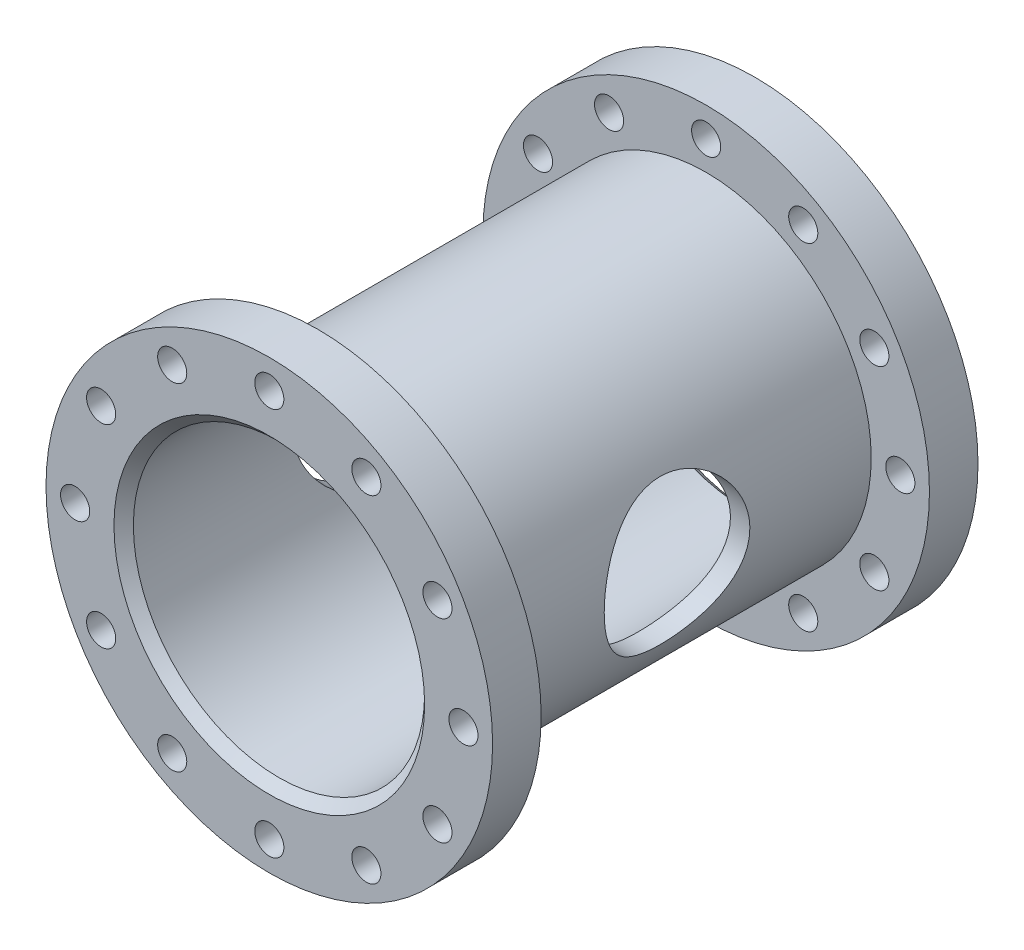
ISO-10303-21;
HEADER;
FILE_DESCRIPTION(('STEP AP214'),'2;1');
FILE_NAME('part.step','',(''),(''),'','','');
FILE_SCHEMA(('AUTOMOTIVE_DESIGN { 1 0 10303 214 1 1 1 1 }'));
ENDSEC;
DATA;
#1=APPLICATION_CONTEXT('core data for automotive mechanical design processes');
#2=APPLICATION_PROTOCOL_DEFINITION('international standard','automotive_design',2000,#1);
#3=PRODUCT_CONTEXT('',#1,'mechanical');
#4=PRODUCT('Part','Part','',(#3));
#5=PRODUCT_RELATED_PRODUCT_CATEGORY('part','',(#4));
#6=PRODUCT_DEFINITION_FORMATION('','',#4);
#7=PRODUCT_DEFINITION_CONTEXT('part definition',#1,'design');
#8=PRODUCT_DEFINITION('design','',#6,#7);
#9=PRODUCT_DEFINITION_SHAPE('','',#8);
#10=(LENGTH_UNIT() NAMED_UNIT(*) SI_UNIT(.MILLI.,.METRE.));
#11=(NAMED_UNIT(*) PLANE_ANGLE_UNIT() SI_UNIT($,.RADIAN.));
#12=(NAMED_UNIT(*) SI_UNIT($,.STERADIAN.) SOLID_ANGLE_UNIT());
#13=UNCERTAINTY_MEASURE_WITH_UNIT(LENGTH_MEASURE(1.E-05),#10,'distance_accuracy_value','');
#14=(GEOMETRIC_REPRESENTATION_CONTEXT(3) GLOBAL_UNCERTAINTY_ASSIGNED_CONTEXT((#13)) GLOBAL_UNIT_ASSIGNED_CONTEXT((#10,
#11,#12)) REPRESENTATION_CONTEXT('',''));
#15=CARTESIAN_POINT('',(0.,0.,0.));
#16=DIRECTION('',(0.,0.,1.));
#17=DIRECTION('',(1.,0.,0.));
#18=AXIS2_PLACEMENT_3D('',#15,#16,#17);
#19=CARTESIAN_POINT('',(0.,0.,100.));
#20=DIRECTION('',(0.,0.,-1.));
#21=DIRECTION('',(-1.,0.,0.));
#22=AXIS2_PLACEMENT_3D('',#19,#20,#21);
#23=CYLINDRICAL_SURFACE('',#22,85.);
#24=CARTESIAN_POINT('',(-85.,0.,37.5));
#25=CARTESIAN_POINT('',(-84.9999938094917,-0.999558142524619,37.4999925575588));
#26=CARTESIAN_POINT('',(-84.9823218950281,-1.99938102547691,37.4599829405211));
#27=CARTESIAN_POINT('',(-84.9120725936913,-3.99183941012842,37.3003359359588));
#28=CARTESIAN_POINT('',(-84.8594750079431,-4.98447041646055,37.1806524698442));
#29=CARTESIAN_POINT('',(-84.7206060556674,-6.95689091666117,36.8626044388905));
#30=CARTESIAN_POINT('',(-84.634261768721,-7.93664782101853,36.6640694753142));
#31=CARTESIAN_POINT('',(-84.430171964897,-9.87394583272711,36.1904619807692));
#32=CARTESIAN_POINT('',(-84.3124308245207,-10.8314900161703,35.9154001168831));
#33=CARTESIAN_POINT('',(-84.04900372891,-12.7147913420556,35.2925534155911));
#34=CARTESIAN_POINT('',(-83.9034183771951,-13.6406491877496,34.9450299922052));
#35=CARTESIAN_POINT('',(-83.5875935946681,-15.4585073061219,34.1797780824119));
#36=CARTESIAN_POINT('',(-83.4173533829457,-16.3505065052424,33.7620473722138));
#37=CARTESIAN_POINT('',(-83.0563173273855,-18.0953489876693,32.8598937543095));
#38=CARTESIAN_POINT('',(-82.8655283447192,-18.948205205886,32.3754930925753));
#39=CARTESIAN_POINT('',(-82.4677562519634,-20.6106750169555,31.3433816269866));
#40=CARTESIAN_POINT('',(-82.2607726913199,-21.4202874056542,30.7956690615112));
#41=CARTESIAN_POINT('',(-81.8245676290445,-23.0319649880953,29.6112811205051));
#42=CARTESIAN_POINT('',(-81.5947513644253,-23.831609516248,28.9715194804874));
#43=CARTESIAN_POINT('',(-81.244831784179,-24.9887965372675,27.965540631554));
#44=CARTESIAN_POINT('',(-81.1273191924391,-25.3674993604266,27.6224706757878));
#45=CARTESIAN_POINT('',(-80.8912465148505,-26.1104994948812,26.9212332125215));
#46=CARTESIAN_POINT('',(-80.7726861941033,-26.4747934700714,26.5630622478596));
#47=CARTESIAN_POINT('',(-80.4164905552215,-27.5454867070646,25.4664522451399));
#48=CARTESIAN_POINT('',(-80.1783998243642,-28.2295032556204,24.7060848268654));
#49=CARTESIAN_POINT('',(-79.7071718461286,-29.533841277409,23.131097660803));
#50=CARTESIAN_POINT('',(-79.4740346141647,-30.1541625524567,22.3164777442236));
#51=CARTESIAN_POINT('',(-79.1262467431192,-31.0507279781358,21.0331974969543));
#52=CARTESIAN_POINT('',(-79.0075496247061,-31.3513216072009,20.5824784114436));
#53=CARTESIAN_POINT('',(-78.7742157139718,-31.9330724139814,19.6678069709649));
#54=CARTESIAN_POINT('',(-78.6595779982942,-32.2142340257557,19.2038576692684));
#55=CARTESIAN_POINT('',(-78.323062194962,-33.0279068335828,17.7928629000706));
#56=CARTESIAN_POINT('',(-78.1085645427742,-33.5306490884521,16.8266089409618));
#57=CARTESIAN_POINT('',(-77.7067115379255,-34.451699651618,14.8498848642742));
#58=CARTESIAN_POINT('',(-77.5193440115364,-34.8700458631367,13.8394348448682));
#59=CARTESIAN_POINT('',(-77.1784027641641,-35.6183017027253,11.7807302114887));
#60=CARTESIAN_POINT('',(-77.0248261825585,-35.9482188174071,10.7324788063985));
#61=CARTESIAN_POINT('',(-76.7644110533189,-36.5008720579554,8.66165695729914));
#62=CARTESIAN_POINT('',(-76.655555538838,-36.7282939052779,7.6405906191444));
#63=CARTESIAN_POINT('',(-76.4776345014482,-37.0973527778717,5.57961708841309));
#64=CARTESIAN_POINT('',(-76.4085676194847,-37.2389927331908,4.53971054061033));
#65=CARTESIAN_POINT('',(-76.3129450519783,-37.4345605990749,2.45031328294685));
#66=CARTESIAN_POINT('',(-76.286365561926,-37.4885376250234,1.4008282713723));
#67=CARTESIAN_POINT('',(-76.2767111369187,-37.5081798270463,-0.699136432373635));
#68=CARTESIAN_POINT('',(-76.2936334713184,-37.4738505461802,-1.74961605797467));
#69=CARTESIAN_POINT('',(-76.3669025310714,-37.3242836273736,-3.75016611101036));
#70=CARTESIAN_POINT('',(-76.4196464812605,-37.2164366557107,-4.70093288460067));
#71=CARTESIAN_POINT('',(-76.5589848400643,-36.9289499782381,-6.58895820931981));
#72=CARTESIAN_POINT('',(-76.6455769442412,-36.7493151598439,-7.52621767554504));
#73=CARTESIAN_POINT('',(-76.8499016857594,-36.3200904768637,-9.38123511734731));
#74=CARTESIAN_POINT('',(-76.9676394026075,-36.0704892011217,-10.2989898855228));
#75=CARTESIAN_POINT('',(-77.2307109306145,-35.5037293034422,-12.1092953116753));
#76=CARTESIAN_POINT('',(-77.3760459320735,-35.1865677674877,-13.0018448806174));
#77=CARTESIAN_POINT('',(-77.6937283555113,-34.4795299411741,-14.7764787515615));
#78=CARTESIAN_POINT('',(-77.8666050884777,-34.0881920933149,-15.6578877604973));
#79=CARTESIAN_POINT('',(-78.1406921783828,-33.4527331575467,-16.952757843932));
#80=CARTESIAN_POINT('',(-78.2345213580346,-33.2328265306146,-17.3798603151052));
#81=CARTESIAN_POINT('',(-78.4265165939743,-32.7771665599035,-18.2246451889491));
#82=CARTESIAN_POINT('',(-78.5246834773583,-32.5414101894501,-18.6423257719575));
#83=CARTESIAN_POINT('',(-78.8247638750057,-31.8109069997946,-19.8805091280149));
#84=CARTESIAN_POINT('',(-79.0322487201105,-31.2929454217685,-20.6861141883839));
#85=CARTESIAN_POINT('',(-79.4569541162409,-30.1982944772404,-22.2536973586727));
#86=CARTESIAN_POINT('',(-79.6741752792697,-29.6216014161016,-23.0156727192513));
#87=CARTESIAN_POINT('',(-80.0140382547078,-28.6858495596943,-24.1587590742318));
#88=CARTESIAN_POINT('',(-80.1350634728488,-28.3462029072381,-24.5563845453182));
#89=CARTESIAN_POINT('',(-80.3776771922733,-27.6507620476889,-25.3369007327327));
#90=CARTESIAN_POINT('',(-80.4992655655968,-27.2949713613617,-25.7197946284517));
#91=CARTESIAN_POINT('',(-80.8637327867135,-26.2039016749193,-26.8458161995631));
#92=CARTESIAN_POINT('',(-81.106323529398,-25.4448983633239,-27.5663163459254));
#93=CARTESIAN_POINT('',(-81.5843306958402,-23.8678893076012,-28.9425234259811));
#94=CARTESIAN_POINT('',(-81.8197449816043,-23.0498662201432,-29.5982111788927));
#95=CARTESIAN_POINT('',(-82.2772567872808,-21.3592996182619,-30.8404022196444));
#96=CARTESIAN_POINT('',(-82.4993543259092,-20.4867561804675,-31.4269056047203));
#97=CARTESIAN_POINT('',(-82.9305458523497,-18.6661341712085,-32.5422439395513));
#98=CARTESIAN_POINT('',(-83.1390802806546,-17.7166030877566,-33.0689285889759));
#99=CARTESIAN_POINT('',(-83.5299938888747,-15.7710023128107,-34.0397912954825));
#100=CARTESIAN_POINT('',(-83.7123722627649,-14.774931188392,-34.4839668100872));
#101=CARTESIAN_POINT('',(-84.0455565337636,-12.7437411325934,-35.285099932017));
#102=CARTESIAN_POINT('',(-84.1963782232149,-11.7086420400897,-35.642101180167));
#103=CARTESIAN_POINT('',(-84.4619948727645,-9.6069199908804,-36.2651085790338));
#104=CARTESIAN_POINT('',(-84.5767929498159,-8.5402997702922,-36.531122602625));
#105=CARTESIAN_POINT('',(-84.760223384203,-6.45904897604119,-36.9537418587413));
#106=CARTESIAN_POINT('',(-84.8315000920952,-5.44592651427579,-37.1166429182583));
#107=CARTESIAN_POINT('',(-84.9377858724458,-3.40786042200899,-37.3589266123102));
#108=CARTESIAN_POINT('',(-84.972796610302,-2.38291733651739,-37.4383130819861));
#109=CARTESIAN_POINT('',(-85.0055603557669,-0.329676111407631,-37.5126164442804));
#110=CARTESIAN_POINT('',(-85.0033240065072,0.698620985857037,-37.5075574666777));
#111=CARTESIAN_POINT('',(-84.9616817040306,2.75055773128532,-37.4130883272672));
#112=CARTESIAN_POINT('',(-84.922276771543,3.77419750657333,-37.3236804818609));
#113=CARTESIAN_POINT('',(-84.8107016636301,5.75047478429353,-37.0690881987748));
#114=CARTESIAN_POINT('',(-84.7405331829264,6.7038261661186,-36.9085274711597));
#115=CARTESIAN_POINT('',(-84.5698855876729,8.59264714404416,-36.5150239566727));
#116=CARTESIAN_POINT('',(-84.4694079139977,9.52811758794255,-36.2820846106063));
#117=CARTESIAN_POINT('',(-84.2405466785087,11.3752606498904,-35.7460264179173));
#118=CARTESIAN_POINT('',(-84.1121612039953,12.2869316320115,-35.4429027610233));
#119=CARTESIAN_POINT('',(-83.8304843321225,14.0809998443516,-34.7691488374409));
#120=CARTESIAN_POINT('',(-83.6771919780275,14.9633959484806,-34.3985159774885));
#121=CARTESIAN_POINT('',(-83.3440562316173,16.7210387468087,-33.580138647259));
#122=CARTESIAN_POINT('',(-83.1635339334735,17.5952043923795,-33.1303499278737));
#123=CARTESIAN_POINT('',(-82.7839218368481,19.3025180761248,-32.1655770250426));
#124=CARTESIAN_POINT('',(-82.5848318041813,20.1356655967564,-31.6505920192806));
#125=CARTESIAN_POINT('',(-82.1725554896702,21.757094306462,-30.5587052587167));
#126=CARTESIAN_POINT('',(-81.959364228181,22.5453594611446,-29.9817815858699));
#127=CARTESIAN_POINT('',(-81.5237566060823,24.072976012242,-28.7696507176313));
#128=CARTESIAN_POINT('',(-81.3013398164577,24.8123251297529,-28.1344408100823));
#129=CARTESIAN_POINT('',(-80.8343658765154,26.2955651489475,-26.7562642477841));
#130=CARTESIAN_POINT('',(-80.5894553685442,27.0351351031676,-26.0087450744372));
#131=CARTESIAN_POINT('',(-80.2233446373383,28.095462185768,-24.8429292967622));
#132=CARTESIAN_POINT('',(-80.1015088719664,28.4407544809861,-24.446873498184));
#133=CARTESIAN_POINT('',(-79.859029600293,29.1146634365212,-23.6402751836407));
#134=CARTESIAN_POINT('',(-79.7383864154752,29.4432756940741,-23.2297288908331));
#135=CARTESIAN_POINT('',(-79.3795052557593,30.4033048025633,-21.9771667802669));
#136=CARTESIAN_POINT('',(-79.1443228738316,31.0088933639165,-21.1142504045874));
#137=CARTESIAN_POINT('',(-78.6889900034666,32.1468296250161,-19.3376303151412));
#138=CARTESIAN_POINT('',(-78.468838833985,32.6791806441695,-18.4239289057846));
#139=CARTESIAN_POINT('',(-78.1526124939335,33.4252042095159,-17.0087883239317));
#140=CARTESIAN_POINT('',(-78.0484699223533,33.6674961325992,-16.5240428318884));
#141=CARTESIAN_POINT('',(-77.8467687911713,34.1312836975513,-15.5434711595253));
#142=CARTESIAN_POINT('',(-77.7492086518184,34.3527843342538,-15.047647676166));
#143=CARTESIAN_POINT('',(-77.5614979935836,34.7745214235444,-14.0455748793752));
#144=CARTESIAN_POINT('',(-77.4713484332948,34.9747551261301,-13.5393242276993));
#145=CARTESIAN_POINT('',(-77.2992903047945,35.3533998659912,-12.5173565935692));
#146=CARTESIAN_POINT('',(-77.2173822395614,35.5318095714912,-12.0016390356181));
#147=CARTESIAN_POINT('',(-76.98534247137,36.0332253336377,-10.4425621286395));
#148=CARTESIAN_POINT('',(-76.8486865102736,36.3228813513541,-9.38617912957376));
#149=CARTESIAN_POINT('',(-76.6169261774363,36.8092300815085,-7.24795076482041));
#150=CARTESIAN_POINT('',(-76.5218172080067,37.0059330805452,-6.16610823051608));
#151=CARTESIAN_POINT('',(-76.3831537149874,37.291241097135,-4.0778377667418));
#152=CARTESIAN_POINT('',(-76.3359422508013,37.387533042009,-3.0727008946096));
#153=CARTESIAN_POINT('',(-76.2814009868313,37.4986909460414,-1.05688223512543));
#154=CARTESIAN_POINT('',(-76.2740688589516,37.5135616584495,-0.0462007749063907));
#155=CARTESIAN_POINT('',(-76.2995529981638,37.4617003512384,1.97235928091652));
#156=CARTESIAN_POINT('',(-76.3323620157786,37.3949830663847,2.98023834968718));
#157=CARTESIAN_POINT('',(-76.4369085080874,37.1808171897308,4.98531349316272));
#158=CARTESIAN_POINT('',(-76.5086454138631,37.0333697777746,5.98250972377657));
#159=CARTESIAN_POINT('',(-76.6831947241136,36.6704991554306,7.90068683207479));
#160=CARTESIAN_POINT('',(-76.7839411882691,36.459562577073,8.82271106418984));
#161=CARTESIAN_POINT('',(-77.0145697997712,35.9698376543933,10.6447485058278));
#162=CARTESIAN_POINT('',(-77.1444504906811,35.6910527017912,11.5447628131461));
#163=CARTESIAN_POINT('',(-77.4296438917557,35.0680410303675,13.3178728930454));
#164=CARTESIAN_POINT('',(-77.584961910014,34.7238006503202,14.1909630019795));
#165=CARTESIAN_POINT('',(-77.9168050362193,33.9726364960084,15.905540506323));
#166=CARTESIAN_POINT('',(-78.0933313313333,33.5657092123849,16.7470261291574));
#167=CARTESIAN_POINT('',(-78.4749185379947,32.6640728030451,18.44699989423));
#168=CARTESIAN_POINT('',(-78.6810805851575,32.1654245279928,19.3031600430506));
#169=CARTESIAN_POINT('',(-79.0003031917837,31.3693136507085,20.5538455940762));
#170=CARTESIAN_POINT('',(-79.108380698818,31.0959026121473,20.9651717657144));
#171=CARTESIAN_POINT('',(-79.3272075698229,30.5333466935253,21.7763259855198));
#172=CARTESIAN_POINT('',(-79.4379574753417,30.2441986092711,22.1761516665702));
#173=CARTESIAN_POINT('',(-79.7731821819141,29.3537334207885,23.3576779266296));
#174=CARTESIAN_POINT('',(-80.0006206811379,28.7294232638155,24.1213839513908));
#175=CARTESIAN_POINT('',(-80.4578103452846,27.4229757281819,25.5969033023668));
#176=CARTESIAN_POINT('',(-80.6875615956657,26.7408362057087,26.308714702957));
#177=CARTESIAN_POINT('',(-81.0396480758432,25.6464274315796,27.3641578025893));
#178=CARTESIAN_POINT('',(-81.1630957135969,25.2532688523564,27.7274047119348));
#179=CARTESIAN_POINT('',(-81.4082135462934,24.4515539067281,28.4369130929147));
#180=CARTESIAN_POINT('',(-81.5298841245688,24.0430009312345,28.7831782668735));
#181=CARTESIAN_POINT('',(-81.8910595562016,22.7948274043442,29.7958666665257));
#182=CARTESIAN_POINT('',(-82.1267382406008,21.9326610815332,30.436212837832));
#183=CARTESIAN_POINT('',(-82.581445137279,20.1531361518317,31.6426537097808));
#184=CARTESIAN_POINT('',(-82.8004645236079,19.2357487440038,32.208709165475));
#185=CARTESIAN_POINT('',(-83.2156854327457,17.3516528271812,33.2616050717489));
#186=CARTESIAN_POINT('',(-83.4118887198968,16.3849481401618,33.7484516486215));
#187=CARTESIAN_POINT('',(-83.773723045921,14.4204306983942,34.6330429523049));
#188=CARTESIAN_POINT('',(-83.9396931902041,13.4231314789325,35.0317882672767));
#189=CARTESIAN_POINT('',(-84.2392004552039,11.3933898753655,35.743491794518));
#190=CARTESIAN_POINT('',(-84.3727324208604,10.3609419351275,36.0564363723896));
#191=CARTESIAN_POINT('',(-84.6030503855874,8.27195457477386,36.5921367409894));
#192=CARTESIAN_POINT('',(-84.6999360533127,7.21548890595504,36.8151372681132));
#193=CARTESIAN_POINT('',(-84.8544757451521,5.0849761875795,37.1693108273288));
#194=CARTESIAN_POINT('',(-84.9121572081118,4.01094197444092,37.300548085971));
#195=CARTESIAN_POINT('',(-84.9662263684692,2.44522906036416,37.423395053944));
#196=CARTESIAN_POINT('',(-84.9788817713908,1.95673901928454,37.4521111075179));
#197=CARTESIAN_POINT('',(-84.9957701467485,0.978853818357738,37.4904155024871));
#198=CARTESIAN_POINT('',(-85.0000030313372,0.489458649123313,37.5000036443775));
#199=CARTESIAN_POINT('',(-85.,0.,37.5));
#200=B_SPLINE_CURVE_WITH_KNOTS('',3,(#24,#25,#26,#27,#28,#29,#30,#31,#32,#33,#34,#35,#36,#37,
#38,#39,#40,#41,#42,#43,#44,#45,#46,#47,#48,#49,#50,#51,#52,#53,#54,#55,#56,#57,#58,#59,#60,#61,
#62,#63,#64,#65,#66,#67,#68,#69,#70,#71,#72,#73,#74,#75,#76,#77,#78,#79,#80,#81,#82,#83,#84,#85,
#86,#87,#88,#89,#90,#91,#92,#93,#94,#95,#96,#97,#98,#99,#100,#101,#102,#103,#104,#105,#106,#107,
#108,#109,#110,#111,#112,#113,#114,#115,#116,#117,#118,#119,#120,#121,#122,#123,#124,#125,#126,
#127,#128,#129,#130,#131,#132,#133,#134,#135,#136,#137,#138,#139,#140,#141,#142,#143,#144,#145,
#146,#147,#148,#149,#150,#151,#152,#153,#154,#155,#156,#157,#158,#159,#160,#161,#162,#163,#164,
#165,#166,#167,#168,#169,#170,#171,#172,#173,#174,#175,#176,#177,#178,#179,#180,#181,#182,#183,
#184,#185,#186,#187,#188,#189,#190,#191,#192,#193,#194,#195,#196,#197,#198,#199),.UNSPECIFIED.,
.T.,.F.,(4,2,2,2,2,2,2,2,2,2,2,2,2,2,2,2,2,2,2,2,2,2,2,2,2,2,2,2,2,2,2,2,2,2,2,2,2,2,2,2,2,2,2,
2,2,2,2,2,2,2,2,2,2,2,2,2,2,2,2,2,2,2,2,2,2,2,2,2,2,2,2,2,2,2,2,2,2,2,2,2,2,2,2,2,2,2,2,4),(0.,
2.99818228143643,5.99810004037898,9.00453623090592,12.0105535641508,15.005908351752,
18.0013580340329,20.9958106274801,23.9903465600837,27.1352601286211,28.7078967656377,
30.2808954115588,33.4276820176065,36.5744784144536,38.2378495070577,39.9008397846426,
43.2265898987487,46.5508430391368,49.8748146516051,53.0257387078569,56.1765551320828,
59.3256056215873,62.4744584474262,65.3460353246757,68.2174167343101,71.0892667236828,
73.9612406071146,76.8971486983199,78.3652425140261,79.8336174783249,82.7705008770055,
85.7075691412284,87.3174488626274,88.9269791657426,92.1459104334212,95.3657914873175,
98.5856680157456,101.898381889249,105.21119782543,108.522351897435,111.833219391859,
114.915039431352,117.996717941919,121.077515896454,124.158229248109,127.062841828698,
129.967316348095,132.871989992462,135.776775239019,138.772144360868,141.767551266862,
144.764021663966,147.760631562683,150.995714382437,152.613470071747,154.231650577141,
157.468105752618,160.704414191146,162.359481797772,164.014150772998,165.669033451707,
167.324017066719,170.630364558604,173.936346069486,176.964861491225,179.993200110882,
183.020991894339,186.048739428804,188.89917028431,191.749458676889,194.60034260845,
197.451386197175,200.483932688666,202.000386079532,203.517149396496,206.550834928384,
209.584632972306,211.23218070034,212.879367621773,216.17360844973,219.469582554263,
222.765301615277,226.021409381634,229.278034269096,232.525737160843,235.771164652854,
237.239284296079,238.707419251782),.UNSPECIFIED.);
#201=CARTESIAN_POINT('',(-85.,0.,37.5));
#202=VERTEX_POINT('',#201);
#203=EDGE_CURVE('E77',#202,#202,#200,.T.);
#204=ORIENTED_EDGE('',*,*,#203,.T.);
#205=EDGE_LOOP('',(#204));
#206=FACE_BOUND('',#205,.T.);
#207=CARTESIAN_POINT('',(85.,0.,-37.5));
#208=CARTESIAN_POINT('',(84.9999938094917,-0.999558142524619,-37.4999925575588));
#209=CARTESIAN_POINT('',(84.9823218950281,-1.99938102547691,-37.4599829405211));
#210=CARTESIAN_POINT('',(84.9120725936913,-3.99183941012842,-37.3003359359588));
#211=CARTESIAN_POINT('',(84.8594750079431,-4.98447041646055,-37.1806524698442));
#212=CARTESIAN_POINT('',(84.7206060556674,-6.95689091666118,-36.8626044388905));
#213=CARTESIAN_POINT('',(84.634261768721,-7.93664782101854,-36.6640694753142));
#214=CARTESIAN_POINT('',(84.430171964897,-9.87394583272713,-36.1904619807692));
#215=CARTESIAN_POINT('',(84.3124308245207,-10.8314900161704,-35.9154001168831));
#216=CARTESIAN_POINT('',(84.04900372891,-12.7147913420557,-35.2925534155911));
#217=CARTESIAN_POINT('',(83.9034183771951,-13.6406491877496,-34.9450299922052));
#218=CARTESIAN_POINT('',(83.5875935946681,-15.4585073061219,-34.1797780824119));
#219=CARTESIAN_POINT('',(83.4173533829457,-16.3505065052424,-33.7620473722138));
#220=CARTESIAN_POINT('',(83.0563173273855,-18.0953489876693,-32.8598937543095));
#221=CARTESIAN_POINT('',(82.8655283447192,-18.9482052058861,-32.3754930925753));
#222=CARTESIAN_POINT('',(82.4677562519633,-20.6106750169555,-31.3433816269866));
#223=CARTESIAN_POINT('',(82.2607726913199,-21.4202874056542,-30.7956690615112));
#224=CARTESIAN_POINT('',(81.8245676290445,-23.0319649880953,-29.6112811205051));
#225=CARTESIAN_POINT('',(81.5947513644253,-23.831609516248,-28.9715194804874));
#226=CARTESIAN_POINT('',(81.2448317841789,-24.9887965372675,-27.965540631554));
#227=CARTESIAN_POINT('',(81.1273191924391,-25.3674993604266,-27.6224706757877));
#228=CARTESIAN_POINT('',(80.8912465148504,-26.1104994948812,-26.9212332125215));
#229=CARTESIAN_POINT('',(80.7726861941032,-26.4747934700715,-26.5630622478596));
#230=CARTESIAN_POINT('',(80.4164905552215,-27.5454867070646,-25.4664522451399));
#231=CARTESIAN_POINT('',(80.1783998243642,-28.2295032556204,-24.7060848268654));
#232=CARTESIAN_POINT('',(79.7071718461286,-29.5338412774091,-23.131097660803));
#233=CARTESIAN_POINT('',(79.4740346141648,-30.1541625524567,-22.3164777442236));
#234=CARTESIAN_POINT('',(79.1262467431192,-31.0507279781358,-21.0331974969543));
#235=CARTESIAN_POINT('',(79.007549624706,-31.3513216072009,-20.5824784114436));
#236=CARTESIAN_POINT('',(78.7742157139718,-31.9330724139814,-19.6678069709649));
#237=CARTESIAN_POINT('',(78.6595779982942,-32.2142340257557,-19.2038576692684));
#238=CARTESIAN_POINT('',(78.323062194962,-33.0279068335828,-17.7928629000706));
#239=CARTESIAN_POINT('',(78.1085645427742,-33.5306490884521,-16.8266089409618));
#240=CARTESIAN_POINT('',(77.7067115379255,-34.451699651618,-14.8498848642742));
#241=CARTESIAN_POINT('',(77.5193440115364,-34.8700458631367,-13.8394348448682));
#242=CARTESIAN_POINT('',(77.178402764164,-35.6183017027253,-11.7807302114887));
#243=CARTESIAN_POINT('',(77.0248261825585,-35.9482188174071,-10.7324788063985));
#244=CARTESIAN_POINT('',(76.7644110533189,-36.5008720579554,-8.6616569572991));
#245=CARTESIAN_POINT('',(76.655555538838,-36.7282939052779,-7.64059061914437));
#246=CARTESIAN_POINT('',(76.4776345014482,-37.0973527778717,-5.57961708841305));
#247=CARTESIAN_POINT('',(76.4085676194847,-37.2389927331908,-4.53971054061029));
#248=CARTESIAN_POINT('',(76.3129450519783,-37.4345605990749,-2.45031328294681));
#249=CARTESIAN_POINT('',(76.286365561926,-37.4885376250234,-1.40082827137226));
#250=CARTESIAN_POINT('',(76.2767111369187,-37.5081798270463,0.699136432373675));
#251=CARTESIAN_POINT('',(76.2936334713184,-37.4738505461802,1.74961605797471));
#252=CARTESIAN_POINT('',(76.3669025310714,-37.3242836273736,3.7501661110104));
#253=CARTESIAN_POINT('',(76.4196464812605,-37.2164366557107,4.70093288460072));
#254=CARTESIAN_POINT('',(76.5589848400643,-36.9289499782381,6.58895820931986));
#255=CARTESIAN_POINT('',(76.6455769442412,-36.7493151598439,7.52621767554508));
#256=CARTESIAN_POINT('',(76.8499016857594,-36.3200904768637,9.38123511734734));
#257=CARTESIAN_POINT('',(76.9676394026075,-36.0704892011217,10.2989898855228));
#258=CARTESIAN_POINT('',(77.2307109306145,-35.5037293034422,12.1092953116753));
#259=CARTESIAN_POINT('',(77.3760459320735,-35.1865677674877,13.0018448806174));
#260=CARTESIAN_POINT('',(77.6937283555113,-34.4795299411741,14.7764787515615));
#261=CARTESIAN_POINT('',(77.8666050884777,-34.0881920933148,15.6578877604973));
#262=CARTESIAN_POINT('',(78.1406921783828,-33.4527331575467,16.952757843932));
#263=CARTESIAN_POINT('',(78.2345213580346,-33.2328265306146,17.3798603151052));
#264=CARTESIAN_POINT('',(78.4265165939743,-32.7771665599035,18.2246451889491));
#265=CARTESIAN_POINT('',(78.5246834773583,-32.5414101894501,18.6423257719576));
#266=CARTESIAN_POINT('',(78.8247638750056,-31.8109069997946,19.8805091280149));
#267=CARTESIAN_POINT('',(79.0322487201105,-31.2929454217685,20.6861141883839));
#268=CARTESIAN_POINT('',(79.4569541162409,-30.1982944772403,22.2536973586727));
#269=CARTESIAN_POINT('',(79.6741752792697,-29.6216014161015,23.0156727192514));
#270=CARTESIAN_POINT('',(80.0140382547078,-28.6858495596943,24.1587590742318));
#271=CARTESIAN_POINT('',(80.1350634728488,-28.3462029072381,24.5563845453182));
#272=CARTESIAN_POINT('',(80.3776771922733,-27.6507620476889,25.3369007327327));
#273=CARTESIAN_POINT('',(80.4992655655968,-27.2949713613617,25.7197946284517));
#274=CARTESIAN_POINT('',(80.8637327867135,-26.2039016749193,26.8458161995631));
#275=CARTESIAN_POINT('',(81.106323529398,-25.4448983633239,27.5663163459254));
#276=CARTESIAN_POINT('',(81.5843306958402,-23.8678893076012,28.9425234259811));
#277=CARTESIAN_POINT('',(81.8197449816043,-23.0498662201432,29.5982111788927));
#278=CARTESIAN_POINT('',(82.2772567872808,-21.3592996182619,30.8404022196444));
#279=CARTESIAN_POINT('',(82.4993543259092,-20.4867561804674,31.4269056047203));
#280=CARTESIAN_POINT('',(82.9305458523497,-18.6661341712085,32.5422439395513));
#281=CARTESIAN_POINT('',(83.1390802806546,-17.7166030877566,33.0689285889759));
#282=CARTESIAN_POINT('',(83.5299938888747,-15.7710023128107,34.0397912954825));
#283=CARTESIAN_POINT('',(83.7123722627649,-14.774931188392,34.4839668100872));
#284=CARTESIAN_POINT('',(84.0455565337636,-12.7437411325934,35.285099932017));
#285=CARTESIAN_POINT('',(84.1963782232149,-11.7086420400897,35.642101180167));
#286=CARTESIAN_POINT('',(84.4619948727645,-9.60691999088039,36.2651085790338));
#287=CARTESIAN_POINT('',(84.5767929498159,-8.54029977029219,36.531122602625));
#288=CARTESIAN_POINT('',(84.760223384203,-6.45904897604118,36.9537418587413));
#289=CARTESIAN_POINT('',(84.8315000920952,-5.44592651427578,37.1166429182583));
#290=CARTESIAN_POINT('',(84.9377858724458,-3.40786042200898,37.3589266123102));
#291=CARTESIAN_POINT('',(84.972796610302,-2.38291733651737,37.4383130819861));
#292=CARTESIAN_POINT('',(85.0055603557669,-0.329676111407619,37.5126164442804));
#293=CARTESIAN_POINT('',(85.0033240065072,0.698620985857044,37.5075574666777));
#294=CARTESIAN_POINT('',(84.9616817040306,2.75055773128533,37.4130883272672));
#295=CARTESIAN_POINT('',(84.922276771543,3.77419750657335,37.3236804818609));
#296=CARTESIAN_POINT('',(84.8107016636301,5.75047478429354,37.0690881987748));
#297=CARTESIAN_POINT('',(84.7405331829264,6.70382616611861,36.9085274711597));
#298=CARTESIAN_POINT('',(84.5698855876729,8.59264714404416,36.5150239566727));
#299=CARTESIAN_POINT('',(84.4694079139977,9.52811758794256,36.2820846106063));
#300=CARTESIAN_POINT('',(84.2405466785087,11.3752606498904,35.7460264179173));
#301=CARTESIAN_POINT('',(84.1121612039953,12.2869316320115,35.4429027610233));
#302=CARTESIAN_POINT('',(83.8304843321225,14.0809998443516,34.7691488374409));
#303=CARTESIAN_POINT('',(83.6771919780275,14.9633959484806,34.3985159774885));
#304=CARTESIAN_POINT('',(83.3440562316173,16.7210387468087,33.580138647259));
#305=CARTESIAN_POINT('',(83.1635339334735,17.5952043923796,33.1303499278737));
#306=CARTESIAN_POINT('',(82.7839218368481,19.3025180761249,32.1655770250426));
#307=CARTESIAN_POINT('',(82.5848318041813,20.1356655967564,31.6505920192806));
#308=CARTESIAN_POINT('',(82.1725554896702,21.7570943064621,30.5587052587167));
#309=CARTESIAN_POINT('',(81.9593642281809,22.5453594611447,29.9817815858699));
#310=CARTESIAN_POINT('',(81.5237566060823,24.072976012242,28.7696507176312));
#311=CARTESIAN_POINT('',(81.3013398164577,24.8123251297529,28.1344408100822));
#312=CARTESIAN_POINT('',(80.8343658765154,26.2955651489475,26.7562642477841));
#313=CARTESIAN_POINT('',(80.5894553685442,27.0351351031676,26.0087450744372));
#314=CARTESIAN_POINT('',(80.2233446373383,28.095462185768,24.8429292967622));
#315=CARTESIAN_POINT('',(80.1015088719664,28.4407544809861,24.446873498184));
#316=CARTESIAN_POINT('',(79.8590296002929,29.1146634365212,23.6402751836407));
#317=CARTESIAN_POINT('',(79.7383864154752,29.4432756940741,23.2297288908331));
#318=CARTESIAN_POINT('',(79.3795052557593,30.4033048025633,21.9771667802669));
#319=CARTESIAN_POINT('',(79.1443228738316,31.0088933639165,21.1142504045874));
#320=CARTESIAN_POINT('',(78.6889900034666,32.1468296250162,19.3376303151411));
#321=CARTESIAN_POINT('',(78.468838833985,32.6791806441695,18.4239289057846));
#322=CARTESIAN_POINT('',(78.1526124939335,33.4252042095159,17.0087883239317));
#323=CARTESIAN_POINT('',(78.0484699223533,33.6674961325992,16.5240428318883));
#324=CARTESIAN_POINT('',(77.8467687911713,34.1312836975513,15.5434711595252));
#325=CARTESIAN_POINT('',(77.7492086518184,34.3527843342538,15.047647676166));
#326=CARTESIAN_POINT('',(77.5614979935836,34.7745214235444,14.0455748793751));
#327=CARTESIAN_POINT('',(77.4713484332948,34.9747551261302,13.5393242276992));
#328=CARTESIAN_POINT('',(77.2992903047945,35.3533998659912,12.5173565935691));
#329=CARTESIAN_POINT('',(77.2173822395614,35.5318095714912,12.0016390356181));
#330=CARTESIAN_POINT('',(76.98534247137,36.0332253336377,10.4425621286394));
#331=CARTESIAN_POINT('',(76.8486865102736,36.3228813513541,9.38617912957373));
#332=CARTESIAN_POINT('',(76.6169261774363,36.8092300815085,7.24795076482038));
#333=CARTESIAN_POINT('',(76.5218172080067,37.0059330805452,6.16610823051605));
#334=CARTESIAN_POINT('',(76.3831537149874,37.291241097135,4.07783776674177));
#335=CARTESIAN_POINT('',(76.3359422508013,37.387533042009,3.07270089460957));
#336=CARTESIAN_POINT('',(76.2814009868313,37.4986909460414,1.05688223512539));
#337=CARTESIAN_POINT('',(76.2740688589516,37.5135616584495,0.0462007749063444));
#338=CARTESIAN_POINT('',(76.2995529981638,37.4617003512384,-1.97235928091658));
#339=CARTESIAN_POINT('',(76.3323620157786,37.3949830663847,-2.98023834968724));
#340=CARTESIAN_POINT('',(76.4369085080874,37.1808171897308,-4.98531349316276));
#341=CARTESIAN_POINT('',(76.5086454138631,37.0333697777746,-5.9825097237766));
#342=CARTESIAN_POINT('',(76.6831947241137,36.6704991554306,-7.90068683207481));
#343=CARTESIAN_POINT('',(76.7839411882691,36.459562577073,-8.82271106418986));
#344=CARTESIAN_POINT('',(77.0145697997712,35.9698376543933,-10.6447485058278));
#345=CARTESIAN_POINT('',(77.1444504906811,35.6910527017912,-11.5447628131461));
#346=CARTESIAN_POINT('',(77.4296438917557,35.0680410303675,-13.3178728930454));
#347=CARTESIAN_POINT('',(77.584961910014,34.7238006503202,-14.1909630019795));
#348=CARTESIAN_POINT('',(77.9168050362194,33.9726364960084,-15.905540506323));
#349=CARTESIAN_POINT('',(78.0933313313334,33.5657092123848,-16.7470261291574));
#350=CARTESIAN_POINT('',(78.4749185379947,32.6640728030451,-18.44699989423));
#351=CARTESIAN_POINT('',(78.6810805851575,32.1654245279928,-19.3031600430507));
#352=CARTESIAN_POINT('',(79.0003031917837,31.3693136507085,-20.5538455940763));
#353=CARTESIAN_POINT('',(79.108380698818,31.0959026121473,-20.9651717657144));
#354=CARTESIAN_POINT('',(79.3272075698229,30.5333466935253,-21.7763259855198));
#355=CARTESIAN_POINT('',(79.4379574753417,30.2441986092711,-22.1761516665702));
#356=CARTESIAN_POINT('',(79.7731821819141,29.3537334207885,-23.3576779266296));
#357=CARTESIAN_POINT('',(80.0006206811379,28.7294232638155,-24.1213839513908));
#358=CARTESIAN_POINT('',(80.4578103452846,27.4229757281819,-25.5969033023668));
#359=CARTESIAN_POINT('',(80.6875615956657,26.7408362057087,-26.308714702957));
#360=CARTESIAN_POINT('',(81.0396480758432,25.6464274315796,-27.3641578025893));
#361=CARTESIAN_POINT('',(81.1630957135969,25.2532688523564,-27.7274047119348));
#362=CARTESIAN_POINT('',(81.4082135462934,24.451553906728,-28.4369130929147));
#363=CARTESIAN_POINT('',(81.5298841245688,24.0430009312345,-28.7831782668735));
#364=CARTESIAN_POINT('',(81.8910595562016,22.7948274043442,-29.7958666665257));
#365=CARTESIAN_POINT('',(82.1267382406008,21.9326610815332,-30.436212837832));
#366=CARTESIAN_POINT('',(82.581445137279,20.1531361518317,-31.6426537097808));
#367=CARTESIAN_POINT('',(82.8004645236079,19.2357487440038,-32.208709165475));
#368=CARTESIAN_POINT('',(83.2156854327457,17.3516528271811,-33.2616050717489));
#369=CARTESIAN_POINT('',(83.4118887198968,16.3849481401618,-33.7484516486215));
#370=CARTESIAN_POINT('',(83.773723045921,14.4204306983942,-34.6330429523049));
#371=CARTESIAN_POINT('',(83.9396931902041,13.4231314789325,-35.0317882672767));
#372=CARTESIAN_POINT('',(84.2392004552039,11.3933898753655,-35.743491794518));
#373=CARTESIAN_POINT('',(84.3727324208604,10.3609419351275,-36.0564363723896));
#374=CARTESIAN_POINT('',(84.6030503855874,8.27195457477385,-36.5921367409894));
#375=CARTESIAN_POINT('',(84.6999360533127,7.21548890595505,-36.8151372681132));
#376=CARTESIAN_POINT('',(84.8544757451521,5.0849761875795,-37.1693108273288));
#377=CARTESIAN_POINT('',(84.9121572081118,4.01094197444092,-37.300548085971));
#378=CARTESIAN_POINT('',(84.9662263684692,2.44522906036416,-37.423395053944));
#379=CARTESIAN_POINT('',(84.9788817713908,1.95673901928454,-37.4521111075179));
#380=CARTESIAN_POINT('',(84.9957701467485,0.978853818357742,-37.4904155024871));
#381=CARTESIAN_POINT('',(85.0000030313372,0.489458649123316,-37.5000036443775));
#382=CARTESIAN_POINT('',(85.,0.,-37.5));
#383=B_SPLINE_CURVE_WITH_KNOTS('',3,(#207,#208,#209,#210,#211,#212,#213,#214,#215,#216,#217,
#218,#219,#220,#221,#222,#223,#224,#225,#226,#227,#228,#229,#230,#231,#232,#233,#234,#235,#236,
#237,#238,#239,#240,#241,#242,#243,#244,#245,#246,#247,#248,#249,#250,#251,#252,#253,#254,#255,
#256,#257,#258,#259,#260,#261,#262,#263,#264,#265,#266,#267,#268,#269,#270,#271,#272,#273,#274,
#275,#276,#277,#278,#279,#280,#281,#282,#283,#284,#285,#286,#287,#288,#289,#290,#291,#292,#293,
#294,#295,#296,#297,#298,#299,#300,#301,#302,#303,#304,#305,#306,#307,#308,#309,#310,#311,#312,
#313,#314,#315,#316,#317,#318,#319,#320,#321,#322,#323,#324,#325,#326,#327,#328,#329,#330,#331,
#332,#333,#334,#335,#336,#337,#338,#339,#340,#341,#342,#343,#344,#345,#346,#347,#348,#349,#350,
#351,#352,#353,#354,#355,#356,#357,#358,#359,#360,#361,#362,#363,#364,#365,#366,#367,#368,#369,
#370,#371,#372,#373,#374,#375,#376,#377,#378,#379,#380,#381,#382),.UNSPECIFIED.,.T.,.F.,(4,2,2,
2,2,2,2,2,2,2,2,2,2,2,2,2,2,2,2,2,2,2,2,2,2,2,2,2,2,2,2,2,2,2,2,2,2,2,2,2,2,2,2,2,2,2,2,2,2,2,2,
2,2,2,2,2,2,2,2,2,2,2,2,2,2,2,2,2,2,2,2,2,2,2,2,2,2,2,2,2,2,2,2,2,2,2,2,4),(0.,2.99818228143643,
5.99810004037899,9.00453623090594,12.0105535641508,15.005908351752,18.0013580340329,
20.9958106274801,23.9903465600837,27.1352601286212,28.7078967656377,30.2808954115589,
33.4276820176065,36.5744784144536,38.2378495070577,39.9008397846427,43.2265898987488,
46.5508430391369,49.8748146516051,53.0257387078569,56.1765551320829,59.3256056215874,
62.4744584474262,65.3460353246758,68.2174167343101,71.0892667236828,73.9612406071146,
76.89714869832,78.3652425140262,79.8336174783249,82.7705008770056,85.7075691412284,
87.3174488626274,88.9269791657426,92.1459104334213,95.3657914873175,98.5856680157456,
101.898381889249,105.21119782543,108.522351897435,111.833219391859,114.915039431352,
117.996717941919,121.077515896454,124.158229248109,127.062841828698,129.967316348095,
132.871989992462,135.77677523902,138.772144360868,141.767551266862,144.764021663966,
147.760631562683,150.995714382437,152.613470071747,154.231650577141,157.468105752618,
160.704414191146,162.359481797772,164.014150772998,165.669033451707,167.324017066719,
170.630364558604,173.936346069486,176.964861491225,179.993200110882,183.020991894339,
186.048739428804,188.89917028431,191.749458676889,194.60034260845,197.451386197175,
200.483932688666,202.000386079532,203.517149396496,206.550834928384,209.584632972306,
211.23218070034,212.879367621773,216.17360844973,219.469582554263,222.765301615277,
226.021409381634,229.278034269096,232.525737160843,235.771164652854,237.239284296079,
238.707419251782),.UNSPECIFIED.);
#384=CARTESIAN_POINT('',(85.,0.,-37.5));
#385=VERTEX_POINT('',#384);
#386=EDGE_CURVE('E73',#385,#385,#383,.T.);
#387=ORIENTED_EDGE('',*,*,#386,.T.);
#388=EDGE_LOOP('',(#387));
#389=FACE_BOUND('',#388,.T.);
#390=CARTESIAN_POINT('',(0.,0.,100.));
#391=DIRECTION('',(0.,0.,1.));
#392=DIRECTION('',(1.,0.,0.));
#393=AXIS2_PLACEMENT_3D('',#390,#391,#392);
#394=CIRCLE('',#393,85.);
#395=CARTESIAN_POINT('',(85.,0.,100.));
#396=VERTEX_POINT('',#395);
#397=EDGE_CURVE('E50',#396,#396,#394,.T.);
#398=ORIENTED_EDGE('',*,*,#397,.F.);
#399=EDGE_LOOP('',(#398));
#400=FACE_BOUND('',#399,.T.);
#401=CARTESIAN_POINT('',(0.,0.,-100.));
#402=DIRECTION('',(0.,0.,1.));
#403=DIRECTION('',(1.,0.,0.));
#404=AXIS2_PLACEMENT_3D('',#401,#402,#403);
#405=CIRCLE('',#404,85.);
#406=CARTESIAN_POINT('',(85.,0.,-100.));
#407=VERTEX_POINT('',#406);
#408=EDGE_CURVE('E100',#407,#407,#405,.T.);
#409=ORIENTED_EDGE('',*,*,#408,.T.);
#410=EDGE_LOOP('',(#409));
#411=FACE_BOUND('',#410,.T.);
#412=ADVANCED_FACE('F33',(#206,#389,#400,#411),#23,.T.);
#413=CARTESIAN_POINT('',(0.,0.,100.));
#414=DIRECTION('',(0.,0.,-1.));
#415=DIRECTION('',(-1.,0.,0.));
#416=AXIS2_PLACEMENT_3D('',#413,#414,#415);
#417=CYLINDRICAL_SURFACE('',#416,75.);
#418=CARTESIAN_POINT('',(-75.,0.,37.5));
#419=CARTESIAN_POINT('',(-74.999998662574,-0.986193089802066,37.4999993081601));
#420=CARTESIAN_POINT('',(-74.9805045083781,-1.97240916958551,37.4610550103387));
#421=CARTESIAN_POINT('',(-74.9030228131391,-3.93760250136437,37.3057274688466));
#422=CARTESIAN_POINT('',(-74.8450185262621,-4.91657641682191,37.1893105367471));
#423=CARTESIAN_POINT('',(-74.6918859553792,-6.86112288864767,36.8801555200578));
#424=CARTESIAN_POINT('',(-74.5966953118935,-7.82667009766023,36.687289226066));
#425=CARTESIAN_POINT('',(-74.3716362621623,-9.73568134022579,36.2274816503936));
#426=CARTESIAN_POINT('',(-74.2417713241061,-10.679147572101,35.9605477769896));
#427=CARTESIAN_POINT('',(-73.9511363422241,-12.5342565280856,35.356616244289));
#428=CARTESIAN_POINT('',(-73.7904891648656,-13.4460092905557,35.0198967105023));
#429=CARTESIAN_POINT('',(-73.4417470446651,-15.2361911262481,34.2789588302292));
#430=CARTESIAN_POINT('',(-73.2536515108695,-16.1146194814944,33.8747390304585));
#431=CARTESIAN_POINT('',(-72.8543105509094,-17.8333321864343,33.0022867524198));
#432=CARTESIAN_POINT('',(-72.6430694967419,-18.673623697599,32.5340663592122));
#433=CARTESIAN_POINT('',(-72.2020184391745,-20.3122776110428,31.5369840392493));
#434=CARTESIAN_POINT('',(-71.972207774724,-21.1106385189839,31.0081199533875));
#435=CARTESIAN_POINT('',(-71.4845728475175,-22.7089289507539,29.8593495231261));
#436=CARTESIAN_POINT('',(-71.2258949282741,-23.5060319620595,29.2358711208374));
#437=CARTESIAN_POINT('',(-70.69924354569,-25.0455392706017,27.9283216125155));
#438=CARTESIAN_POINT('',(-70.4312697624,-25.7879416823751,27.2442484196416));
#439=CARTESIAN_POINT('',(-69.8921368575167,-27.2152804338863,25.818529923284));
#440=CARTESIAN_POINT('',(-69.6209756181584,-27.9001757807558,25.0768442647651));
#441=CARTESIAN_POINT('',(-69.2170200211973,-28.8812979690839,23.9243655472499));
#442=CARTESIAN_POINT('',(-69.082826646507,-29.2006483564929,23.5335293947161));
#443=CARTESIAN_POINT('',(-68.8161526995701,-29.8236813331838,22.738800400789));
#444=CARTESIAN_POINT('',(-68.6836726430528,-30.1273592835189,22.3349037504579));
#445=CARTESIAN_POINT('',(-68.2697902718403,-31.0599623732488,21.0408091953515));
#446=CARTESIAN_POINT('',(-67.9930820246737,-31.6595117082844,20.1276493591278));
#447=CARTESIAN_POINT('',(-67.4605448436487,-32.7789470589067,18.2479292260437));
#448=CARTESIAN_POINT('',(-67.2047145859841,-33.2988381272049,17.2813723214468));
#449=CARTESIAN_POINT('',(-66.843348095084,-34.0152655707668,15.7960122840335));
#450=CARTESIAN_POINT('',(-66.726627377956,-34.2434972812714,15.2949958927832));
#451=CARTESIAN_POINT('',(-66.5017144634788,-34.678262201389,14.2818712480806));
#452=CARTESIAN_POINT('',(-66.3935201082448,-34.8848009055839,13.7697658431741));
#453=CARTESIAN_POINT('',(-66.1866975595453,-35.2756287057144,12.7352170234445));
#454=CARTESIAN_POINT('',(-66.0880694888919,-35.4599175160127,12.2127734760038));
#455=CARTESIAN_POINT('',(-65.9013921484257,-35.8056563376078,11.1585333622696));
#456=CARTESIAN_POINT('',(-65.8133434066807,-35.9671052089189,10.626736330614));
#457=CARTESIAN_POINT('',(-65.5763727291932,-36.3983959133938,9.08299092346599));
#458=CARTESIAN_POINT('',(-65.4420548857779,-36.6386207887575,8.06027271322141));
#459=CARTESIAN_POINT('',(-65.2197567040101,-37.0328865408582,5.9935170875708));
#460=CARTESIAN_POINT('',(-65.1317743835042,-37.1869311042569,4.94948058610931));
#461=CARTESIAN_POINT('',(-65.0059650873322,-37.4064249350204,2.84995759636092));
#462=CARTESIAN_POINT('',(-64.9680956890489,-37.4719491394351,1.7944815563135));
#463=CARTESIAN_POINT('',(-64.9440967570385,-37.5135311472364,-0.31876267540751));
#464=CARTESIAN_POINT('',(-64.9579622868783,-37.4895974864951,-1.37653063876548));
#465=CARTESIAN_POINT('',(-65.0320364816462,-37.3609231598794,-3.35796438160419));
#466=CARTESIAN_POINT('',(-65.0864959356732,-37.2662037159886,-4.28251854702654));
#467=CARTESIAN_POINT('',(-65.2330817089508,-37.0090120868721,-6.11903506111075));
#468=CARTESIAN_POINT('',(-65.3252044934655,-36.846546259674,-7.03099858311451));
#469=CARTESIAN_POINT('',(-65.54412531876,-36.4556945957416,-8.8366252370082));
#470=CARTESIAN_POINT('',(-65.6709320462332,-36.2272922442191,-9.73028372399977));
#471=CARTESIAN_POINT('',(-65.9553002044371,-35.7069484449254,-11.493877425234));
#472=CARTESIAN_POINT('',(-66.1128632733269,-35.4150036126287,-12.3638113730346));
#473=CARTESIAN_POINT('',(-66.4581921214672,-34.7627374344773,-14.0953101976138));
#474=CARTESIAN_POINT('',(-66.6465737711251,-34.4009869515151,-14.9562127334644));
#475=CARTESIAN_POINT('',(-67.0456095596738,-33.6166586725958,-16.6444183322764));
#476=CARTESIAN_POINT('',(-67.2562637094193,-33.194080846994,-17.4717213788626));
#477=CARTESIAN_POINT('',(-67.6945811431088,-32.2907988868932,-19.0896041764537));
#478=CARTESIAN_POINT('',(-67.9222502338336,-31.8100748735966,-19.8801712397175));
#479=CARTESIAN_POINT('',(-68.3892053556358,-30.7933361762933,-21.4213169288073));
#480=CARTESIAN_POINT('',(-68.6284921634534,-30.2573177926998,-22.171892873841));
#481=CARTESIAN_POINT('',(-69.144222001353,-29.0611888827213,-23.7228606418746));
#482=CARTESIAN_POINT('',(-69.4215273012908,-28.3939626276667,-24.5174902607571));
#483=CARTESIAN_POINT('',(-69.9769528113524,-26.9961424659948,-26.0486669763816));
#484=CARTESIAN_POINT('',(-70.2550730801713,-26.265543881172,-26.7852097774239));
#485=CARTESIAN_POINT('',(-70.8052180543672,-24.7442028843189,-28.19665755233));
#486=CARTESIAN_POINT('',(-71.0772398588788,-23.9534326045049,-28.8715336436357));
#487=CARTESIAN_POINT('',(-71.6082731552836,-22.315826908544,-30.1552028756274));
#488=CARTESIAN_POINT('',(-71.8672845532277,-21.4689910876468,-30.7639955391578));
#489=CARTESIAN_POINT('',(-72.3774301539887,-19.6827287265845,-31.9379845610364));
#490=CARTESIAN_POINT('',(-72.6276351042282,-18.7408265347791,-32.499828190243));
#491=CARTESIAN_POINT('',(-73.0996505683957,-16.8057374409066,-33.5413846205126));
#492=CARTESIAN_POINT('',(-73.3214597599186,-15.8125481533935,-34.0210935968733));
#493=CARTESIAN_POINT('',(-73.7300596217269,-13.7822258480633,-34.892978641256));
#494=CARTESIAN_POINT('',(-73.9168725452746,-12.7451212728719,-35.2852103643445));
#495=CARTESIAN_POINT('',(-74.2499288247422,-10.6343349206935,-35.9776904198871));
#496=CARTESIAN_POINT('',(-74.3961768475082,-9.56065736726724,-36.2779493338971));
#497=CARTESIAN_POINT('',(-74.6332174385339,-7.47600307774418,-36.7614969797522));
#498=CARTESIAN_POINT('',(-74.7276001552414,-6.46719969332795,-36.9524146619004));
#499=CARTESIAN_POINT('',(-74.8757259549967,-4.43439729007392,-37.2510568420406));
#500=CARTESIAN_POINT('',(-74.9294712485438,-3.41039910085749,-37.3587858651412));
#501=CARTESIAN_POINT('',(-74.9947785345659,-1.35608044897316,-37.4895987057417));
#502=CARTESIAN_POINT('',(-75.0063573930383,-0.325762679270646,-37.5127163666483));
#503=CARTESIAN_POINT('',(-74.987042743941,1.73285733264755,-37.4740830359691));
#504=CARTESIAN_POINT('',(-74.9561511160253,2.76115966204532,-37.4123358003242));
#505=CARTESIAN_POINT('',(-74.8568142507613,4.72760914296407,-37.2128923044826));
#506=CARTESIAN_POINT('',(-74.7914705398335,5.66655794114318,-37.0814642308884));
#507=CARTESIAN_POINT('',(-74.6270029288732,7.52888772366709,-36.7486123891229));
#508=CARTESIAN_POINT('',(-74.5278812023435,8.45226970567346,-36.5471931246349));
#509=CARTESIAN_POINT('',(-74.2981691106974,10.2775660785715,-36.0764480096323));
#510=CARTESIAN_POINT('',(-74.167576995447,11.1794792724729,-35.8071183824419));
#511=CARTESIAN_POINT('',(-73.8778797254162,12.9564430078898,-35.2031432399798));
#512=CARTESIAN_POINT('',(-73.7187733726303,13.8314924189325,-34.8684949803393));
#513=CARTESIAN_POINT('',(-73.3706155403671,15.5744983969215,-34.1263484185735));
#514=CARTESIAN_POINT('',(-73.1808392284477,16.4415403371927,-33.7170440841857));
#515=CARTESIAN_POINT('',(-72.7790010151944,18.1377169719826,-32.8357542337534));
#516=CARTESIAN_POINT('',(-72.5669389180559,18.9668513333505,-32.3637681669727));
#517=CARTESIAN_POINT('',(-72.1249982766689,20.5836646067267,-31.3602986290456));
#518=CARTESIAN_POINT('',(-71.8951139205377,21.3713298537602,-30.8287957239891));
#519=CARTESIAN_POINT('',(-71.4223879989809,22.9016149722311,-29.7096743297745));
#520=CARTESIAN_POINT('',(-71.1795457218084,23.644232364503,-29.1220527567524));
#521=CARTESIAN_POINT('',(-70.6616480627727,25.1520922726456,-27.8334325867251));
#522=CARTESIAN_POINT('',(-70.3857719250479,25.9123890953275,-27.1269670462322));
#523=CARTESIAN_POINT('',(-69.8313340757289,27.3714094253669,-25.6540599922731));
#524=CARTESIAN_POINT('',(-69.5527721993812,28.0701291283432,-24.8876147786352));
#525=CARTESIAN_POINT('',(-68.9999011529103,29.4029663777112,-23.2978943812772));
#526=CARTESIAN_POINT('',(-68.7255949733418,30.0370400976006,-22.4745812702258));
#527=CARTESIAN_POINT('',(-68.3231431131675,30.9363230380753,-21.2005714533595));
#528=CARTESIAN_POINT('',(-68.1904894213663,31.2274549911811,-20.7693796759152));
#529=CARTESIAN_POINT('',(-67.9290630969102,31.7921246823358,-19.8942721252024));
#530=CARTESIAN_POINT('',(-67.8002917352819,32.0656566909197,-19.4503522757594));
#531=CARTESIAN_POINT('',(-67.4090528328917,32.8846047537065,-18.0568598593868));
#532=CARTESIAN_POINT('',(-67.1548215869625,33.3992470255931,-17.0866032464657));
#533=CARTESIAN_POINT('',(-66.6767164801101,34.3437926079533,-15.0984954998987));
#534=CARTESIAN_POINT('',(-66.4528392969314,34.77370519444,-14.0806495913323));
#535=CARTESIAN_POINT('',(-66.1463497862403,35.3512047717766,-12.5239233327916));
#536=CARTESIAN_POINT('',(-66.0490981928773,35.5324337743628,-12.0001773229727));
#537=CARTESIAN_POINT('',(-65.8653239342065,35.8719444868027,-10.943553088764));
#538=CARTESIAN_POINT('',(-65.7787984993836,36.030232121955,-10.4106772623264));
#539=CARTESIAN_POINT('',(-65.6174026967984,36.3233324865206,-9.33677038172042));
#540=CARTESIAN_POINT('',(-65.5425320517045,36.4581457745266,-8.79573952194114));
#541=CARTESIAN_POINT('',(-65.4052849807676,36.7037925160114,-7.70670834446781));
#542=CARTESIAN_POINT('',(-65.3429090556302,36.8146250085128,-7.15870774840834));
#543=CARTESIAN_POINT('',(-65.1863808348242,37.0914882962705,-5.61195929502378));
#544=CARTESIAN_POINT('',(-65.1072362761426,37.229832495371,-4.60652588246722));
#545=CARTESIAN_POINT('',(-64.9955042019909,37.4245506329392,-2.58535006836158));
#546=CARTESIAN_POINT('',(-64.9629135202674,37.4809301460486,-1.56960837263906));
#547=CARTESIAN_POINT('',(-64.9456089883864,37.510907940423,0.463163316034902));
#548=CARTESIAN_POINT('',(-64.9608774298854,37.4845368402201,1.4801926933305));
#549=CARTESIAN_POINT('',(-65.0386267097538,37.3494722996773,3.50689824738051));
#550=CARTESIAN_POINT('',(-65.1011056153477,37.2407822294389,4.51657472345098));
#551=CARTESIAN_POINT('',(-65.2625981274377,36.9569609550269,6.42436636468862));
#552=CARTESIAN_POINT('',(-65.3575551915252,36.7891619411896,7.32393106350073));
#553=CARTESIAN_POINT('',(-65.5809345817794,36.3894681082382,9.10434042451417));
#554=CARTESIAN_POINT('',(-65.70935424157,36.1575783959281,9.98518657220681));
#555=CARTESIAN_POINT('',(-65.9958785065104,35.6319171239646,11.7235290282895));
#556=CARTESIAN_POINT('',(-66.1539900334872,35.3381311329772,12.5810198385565));
#557=CARTESIAN_POINT('',(-66.410054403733,34.8530916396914,13.8461606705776));
#558=CARTESIAN_POINT('',(-66.4985658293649,34.6840044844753,14.2643880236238));
#559=CARTESIAN_POINT('',(-66.6813338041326,34.3313150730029,15.0935013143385));
#560=CARTESIAN_POINT('',(-66.7755914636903,34.1477100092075,15.5043858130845));
#561=CARTESIAN_POINT('',(-67.0790463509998,33.5501097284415,16.7797379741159));
#562=CARTESIAN_POINT('',(-67.2974101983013,33.1108916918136,17.6303654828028));
#563=CARTESIAN_POINT('',(-67.7517220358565,32.1710497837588,19.2920953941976));
#564=CARTESIAN_POINT('',(-67.9876715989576,31.6704204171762,20.1031942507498));
#565=CARTESIAN_POINT('',(-68.3504169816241,30.8756442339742,21.2878122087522));
#566=CARTESIAN_POINT('',(-68.4728457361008,30.6033126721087,21.6774744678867));
#567=CARTESIAN_POINT('',(-68.7198932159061,30.0444604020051,22.445621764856));
#568=CARTESIAN_POINT('',(-68.8445114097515,29.7579431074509,22.824109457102));
#569=CARTESIAN_POINT('',(-69.2206589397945,28.8774596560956,23.9424874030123));
#570=CARTESIAN_POINT('',(-69.4744798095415,28.2625650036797,24.6652879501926));
#571=CARTESIAN_POINT('',(-70.0134820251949,26.9018757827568,26.1470904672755));
#572=CARTESIAN_POINT('',(-70.2987229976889,26.149256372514,26.8998037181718));
#573=CARTESIAN_POINT('',(-70.8622300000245,24.5812605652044,28.3398075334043));
#574=CARTESIAN_POINT('',(-71.1404954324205,23.7658788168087,29.0270925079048));
#575=CARTESIAN_POINT('',(-71.6828991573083,22.0760011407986,30.3321699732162));
#576=CARTESIAN_POINT('',(-71.9470290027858,21.201470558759,30.9499211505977));
#577=CARTESIAN_POINT('',(-72.4539896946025,19.3983545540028,32.1107972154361));
#578=CARTESIAN_POINT('',(-72.6968217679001,18.4697722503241,32.6539264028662));
#579=CARTESIAN_POINT('',(-73.1562495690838,16.5570978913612,33.6643850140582));
#580=CARTESIAN_POINT('',(-73.3726451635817,15.5726562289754,34.1311443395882));
#581=CARTESIAN_POINT('',(-73.7710228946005,13.560502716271,34.9793400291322));
#582=CARTESIAN_POINT('',(-73.9530001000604,12.532784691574,35.3607641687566));
#583=CARTESIAN_POINT('',(-74.1957984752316,10.9664263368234,35.8648554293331));
#584=CARTESIAN_POINT('',(-74.27163704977,10.4407632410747,36.0214112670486));
#585=CARTESIAN_POINT('',(-74.4128165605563,9.38178086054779,36.3116153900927));
#586=CARTESIAN_POINT('',(-74.4781588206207,8.84846255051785,36.4452665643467));
#587=CARTESIAN_POINT('',(-74.5978030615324,7.77554385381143,36.6891467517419));
#588=CARTESIAN_POINT('',(-74.6521101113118,7.2359464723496,36.7993865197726));
#589=CARTESIAN_POINT('',(-74.7492841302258,6.15148788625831,36.9961187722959));
#590=CARTESIAN_POINT('',(-74.7921528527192,5.60662750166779,37.0826148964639));
#591=CARTESIAN_POINT('',(-74.8574300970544,4.64124337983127,37.2140735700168));
#592=CARTESIAN_POINT('',(-74.8822792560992,4.22155592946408,37.2640195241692));
#593=CARTESIAN_POINT('',(-74.9249590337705,3.38050668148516,37.3497100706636));
#594=CARTESIAN_POINT('',(-74.942791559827,2.95914537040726,37.3854585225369));
#595=CARTESIAN_POINT('',(-74.9856378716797,1.69314604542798,37.4713033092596));
#596=CARTESIAN_POINT('',(-75.0000011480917,0.846581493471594,37.5000005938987));
#597=CARTESIAN_POINT('',(-75.,0.,37.5));
#598=B_SPLINE_CURVE_WITH_KNOTS('',3,(#418,#419,#420,#421,#422,#423,#424,#425,#426,#427,#428,
#429,#430,#431,#432,#433,#434,#435,#436,#437,#438,#439,#440,#441,#442,#443,#444,#445,#446,#447,
#448,#449,#450,#451,#452,#453,#454,#455,#456,#457,#458,#459,#460,#461,#462,#463,#464,#465,#466,
#467,#468,#469,#470,#471,#472,#473,#474,#475,#476,#477,#478,#479,#480,#481,#482,#483,#484,#485,
#486,#487,#488,#489,#490,#491,#492,#493,#494,#495,#496,#497,#498,#499,#500,#501,#502,#503,#504,
#505,#506,#507,#508,#509,#510,#511,#512,#513,#514,#515,#516,#517,#518,#519,#520,#521,#522,#523,
#524,#525,#526,#527,#528,#529,#530,#531,#532,#533,#534,#535,#536,#537,#538,#539,#540,#541,#542,
#543,#544,#545,#546,#547,#548,#549,#550,#551,#552,#553,#554,#555,#556,#557,#558,#559,#560,#561,
#562,#563,#564,#565,#566,#567,#568,#569,#570,#571,#572,#573,#574,#575,#576,#577,#578,#579,#580,
#581,#582,#583,#584,#585,#586,#587,#588,#589,#590,#591,#592,#593,#594,#595,#596,#597),
.UNSPECIFIED.,.T.,.F.,(4,2,2,2,2,2,2,2,2,2,2,2,2,2,2,2,2,2,2,2,2,2,2,2,2,2,2,2,2,2,2,2,2,2,2,2,
2,2,2,2,2,2,2,2,2,2,2,2,2,2,2,2,2,2,2,2,2,2,2,2,2,2,2,2,2,2,2,2,2,2,2,2,2,2,2,2,2,2,2,2,2,2,2,2,
2,2,2,2,2,4),(0.,2.95766470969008,5.91661638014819,8.88055149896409,11.8441902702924,
14.7962373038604,17.7483479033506,20.6999018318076,23.6515608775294,26.7817708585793,
29.9120886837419,33.0446192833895,34.6110234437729,36.1778886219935,39.5541595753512,
42.930216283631,44.6180858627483,46.3055268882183,47.9929895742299,49.6805364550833,
52.8529014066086,56.0251306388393,59.1946727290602,62.363912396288,65.1535853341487,
67.9429965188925,70.7331069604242,73.5233660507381,76.378356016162,79.2333473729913,
82.0893175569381,84.9454789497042,88.1640233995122,91.3828056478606,94.6030878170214,
97.8233932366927,101.19373637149,104.564236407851,107.932585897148,111.300547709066,
114.389524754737,117.478333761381,120.565907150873,123.653343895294,126.501097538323,
129.348667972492,132.196396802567,135.044245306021,137.973343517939,140.902467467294,
143.832550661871,146.762794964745,149.980937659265,153.199279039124,156.419787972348,
158.030150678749,159.641034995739,163.018370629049,166.395336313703,168.082844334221,
169.769915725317,171.456946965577,173.144045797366,176.19334345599,179.242433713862,
182.290395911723,185.338233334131,188.095149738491,190.851846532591,193.609186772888,
194.988057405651,196.367195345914,199.30976828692,202.25260472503,203.725032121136,
205.197106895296,208.14127347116,211.443515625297,214.746039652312,218.050515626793,
221.35480110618,224.682726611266,228.011128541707,229.671712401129,231.332086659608,
232.991696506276,234.651051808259,235.920893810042,237.190390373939,239.72934976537),.UNSPECIFIED.);
#599=CARTESIAN_POINT('',(-75.,0.,37.5));
#600=VERTEX_POINT('',#599);
#601=EDGE_CURVE('E37',#600,#600,#598,.T.);
#602=ORIENTED_EDGE('',*,*,#601,.F.);
#603=EDGE_LOOP('',(#602));
#604=FACE_BOUND('',#603,.T.);
#605=CARTESIAN_POINT('',(75.,0.,-37.5));
#606=CARTESIAN_POINT('',(74.999998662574,-0.986193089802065,-37.4999993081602));
#607=CARTESIAN_POINT('',(74.9805045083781,-1.97240916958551,-37.4610550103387));
#608=CARTESIAN_POINT('',(74.9030228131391,-3.93760250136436,-37.3057274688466));
#609=CARTESIAN_POINT('',(74.8450185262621,-4.91657641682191,-37.1893105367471));
#610=CARTESIAN_POINT('',(74.6918859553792,-6.86112288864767,-36.8801555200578));
#611=CARTESIAN_POINT('',(74.5966953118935,-7.82667009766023,-36.687289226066));
#612=CARTESIAN_POINT('',(74.3716362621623,-9.7356813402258,-36.2274816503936));
#613=CARTESIAN_POINT('',(74.2417713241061,-10.679147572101,-35.9605477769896));
#614=CARTESIAN_POINT('',(73.9511363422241,-12.5342565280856,-35.356616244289));
#615=CARTESIAN_POINT('',(73.7904891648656,-13.4460092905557,-35.0198967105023));
#616=CARTESIAN_POINT('',(73.4417470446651,-15.2361911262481,-34.2789588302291));
#617=CARTESIAN_POINT('',(73.2536515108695,-16.1146194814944,-33.8747390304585));
#618=CARTESIAN_POINT('',(72.8543105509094,-17.8333321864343,-33.0022867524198));
#619=CARTESIAN_POINT('',(72.6430694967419,-18.673623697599,-32.5340663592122));
#620=CARTESIAN_POINT('',(72.2020184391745,-20.3122776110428,-31.5369840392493));
#621=CARTESIAN_POINT('',(71.972207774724,-21.1106385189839,-31.0081199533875));
#622=CARTESIAN_POINT('',(71.4845728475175,-22.708928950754,-29.8593495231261));
#623=CARTESIAN_POINT('',(71.225894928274,-23.5060319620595,-29.2358711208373));
#624=CARTESIAN_POINT('',(70.69924354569,-25.0455392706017,-27.9283216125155));
#625=CARTESIAN_POINT('',(70.4312697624,-25.7879416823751,-27.2442484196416));
#626=CARTESIAN_POINT('',(69.8921368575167,-27.2152804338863,-25.818529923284));
#627=CARTESIAN_POINT('',(69.6209756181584,-27.9001757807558,-25.0768442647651));
#628=CARTESIAN_POINT('',(69.2170200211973,-28.8812979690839,-23.9243655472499));
#629=CARTESIAN_POINT('',(69.082826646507,-29.200648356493,-23.5335293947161));
#630=CARTESIAN_POINT('',(68.8161526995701,-29.8236813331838,-22.738800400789));
#631=CARTESIAN_POINT('',(68.6836726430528,-30.1273592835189,-22.3349037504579));
#632=CARTESIAN_POINT('',(68.2697902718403,-31.0599623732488,-21.0408091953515));
#633=CARTESIAN_POINT('',(67.9930820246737,-31.6595117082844,-20.1276493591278));
#634=CARTESIAN_POINT('',(67.4605448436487,-32.7789470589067,-18.2479292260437));
#635=CARTESIAN_POINT('',(67.2047145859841,-33.2988381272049,-17.2813723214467));
#636=CARTESIAN_POINT('',(66.843348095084,-34.0152655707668,-15.7960122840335));
#637=CARTESIAN_POINT('',(66.726627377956,-34.2434972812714,-15.2949958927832));
#638=CARTESIAN_POINT('',(66.5017144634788,-34.678262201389,-14.2818712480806));
#639=CARTESIAN_POINT('',(66.3935201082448,-34.8848009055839,-13.7697658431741));
#640=CARTESIAN_POINT('',(66.1866975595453,-35.2756287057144,-12.7352170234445));
#641=CARTESIAN_POINT('',(66.0880694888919,-35.4599175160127,-12.2127734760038));
#642=CARTESIAN_POINT('',(65.9013921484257,-35.8056563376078,-11.1585333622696));
#643=CARTESIAN_POINT('',(65.8133434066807,-35.9671052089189,-10.626736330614));
#644=CARTESIAN_POINT('',(65.5763727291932,-36.3983959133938,-9.08299092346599));
#645=CARTESIAN_POINT('',(65.4420548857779,-36.6386207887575,-8.06027271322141));
#646=CARTESIAN_POINT('',(65.2197567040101,-37.0328865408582,-5.9935170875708));
#647=CARTESIAN_POINT('',(65.1317743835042,-37.1869311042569,-4.94948058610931));
#648=CARTESIAN_POINT('',(65.0059650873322,-37.4064249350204,-2.84995759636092));
#649=CARTESIAN_POINT('',(64.9680956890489,-37.4719491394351,-1.79448155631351));
#650=CARTESIAN_POINT('',(64.9440967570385,-37.5135311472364,0.318762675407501));
#651=CARTESIAN_POINT('',(64.9579622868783,-37.4895974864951,1.37653063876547));
#652=CARTESIAN_POINT('',(65.0320364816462,-37.3609231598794,3.35796438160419));
#653=CARTESIAN_POINT('',(65.0864959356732,-37.2662037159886,4.28251854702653));
#654=CARTESIAN_POINT('',(65.2330817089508,-37.0090120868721,6.11903506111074));
#655=CARTESIAN_POINT('',(65.3252044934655,-36.846546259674,7.0309985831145));
#656=CARTESIAN_POINT('',(65.54412531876,-36.4556945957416,8.8366252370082));
#657=CARTESIAN_POINT('',(65.6709320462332,-36.2272922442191,9.73028372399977));
#658=CARTESIAN_POINT('',(65.9553002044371,-35.7069484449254,11.493877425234));
#659=CARTESIAN_POINT('',(66.1128632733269,-35.4150036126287,12.3638113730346));
#660=CARTESIAN_POINT('',(66.4581921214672,-34.7627374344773,14.0953101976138));
#661=CARTESIAN_POINT('',(66.6465737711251,-34.4009869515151,14.9562127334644));
#662=CARTESIAN_POINT('',(67.0456095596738,-33.6166586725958,16.6444183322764));
#663=CARTESIAN_POINT('',(67.2562637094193,-33.194080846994,17.4717213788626));
#664=CARTESIAN_POINT('',(67.6945811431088,-32.2907988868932,19.0896041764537));
#665=CARTESIAN_POINT('',(67.9222502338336,-31.8100748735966,19.8801712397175));
#666=CARTESIAN_POINT('',(68.3892053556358,-30.7933361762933,21.4213169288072));
#667=CARTESIAN_POINT('',(68.6284921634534,-30.2573177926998,22.171892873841));
#668=CARTESIAN_POINT('',(69.144222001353,-29.0611888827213,23.7228606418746));
#669=CARTESIAN_POINT('',(69.4215273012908,-28.3939626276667,24.5174902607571));
#670=CARTESIAN_POINT('',(69.9769528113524,-26.9961424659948,26.0486669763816));
#671=CARTESIAN_POINT('',(70.2550730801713,-26.265543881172,26.7852097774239));
#672=CARTESIAN_POINT('',(70.8052180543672,-24.7442028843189,28.1966575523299));
#673=CARTESIAN_POINT('',(71.0772398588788,-23.9534326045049,28.8715336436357));
#674=CARTESIAN_POINT('',(71.6082731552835,-22.3158269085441,30.1552028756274));
#675=CARTESIAN_POINT('',(71.8672845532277,-21.4689910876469,30.7639955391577));
#676=CARTESIAN_POINT('',(72.3774301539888,-19.6827287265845,31.9379845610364));
#677=CARTESIAN_POINT('',(72.6276351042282,-18.7408265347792,32.499828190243));
#678=CARTESIAN_POINT('',(73.0996505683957,-16.8057374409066,33.5413846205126));
#679=CARTESIAN_POINT('',(73.3214597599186,-15.8125481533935,34.0210935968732));
#680=CARTESIAN_POINT('',(73.7300596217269,-13.7822258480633,34.892978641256));
#681=CARTESIAN_POINT('',(73.9168725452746,-12.7451212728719,35.2852103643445));
#682=CARTESIAN_POINT('',(74.2499288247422,-10.6343349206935,35.9776904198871));
#683=CARTESIAN_POINT('',(74.3961768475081,-9.56065736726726,36.2779493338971));
#684=CARTESIAN_POINT('',(74.6332174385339,-7.47600307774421,36.7614969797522));
#685=CARTESIAN_POINT('',(74.7276001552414,-6.46719969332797,36.9524146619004));
#686=CARTESIAN_POINT('',(74.8757259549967,-4.43439729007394,37.2510568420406));
#687=CARTESIAN_POINT('',(74.9294712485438,-3.41039910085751,37.3587858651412));
#688=CARTESIAN_POINT('',(74.9947785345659,-1.35608044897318,37.4895987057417));
#689=CARTESIAN_POINT('',(75.0063573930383,-0.325762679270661,37.5127163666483));
#690=CARTESIAN_POINT('',(74.987042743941,1.73285733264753,37.4740830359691));
#691=CARTESIAN_POINT('',(74.9561511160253,2.76115966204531,37.4123358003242));
#692=CARTESIAN_POINT('',(74.8568142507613,4.72760914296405,37.2128923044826));
#693=CARTESIAN_POINT('',(74.7914705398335,5.66655794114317,37.0814642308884));
#694=CARTESIAN_POINT('',(74.6270029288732,7.52888772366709,36.7486123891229));
#695=CARTESIAN_POINT('',(74.5278812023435,8.45226970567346,36.5471931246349));
#696=CARTESIAN_POINT('',(74.2981691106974,10.2775660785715,36.0764480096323));
#697=CARTESIAN_POINT('',(74.167576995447,11.1794792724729,35.8071183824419));
#698=CARTESIAN_POINT('',(73.8778797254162,12.9564430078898,35.2031432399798));
#699=CARTESIAN_POINT('',(73.7187733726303,13.8314924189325,34.8684949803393));
#700=CARTESIAN_POINT('',(73.3706155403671,15.5744983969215,34.1263484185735));
#701=CARTESIAN_POINT('',(73.1808392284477,16.4415403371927,33.7170440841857));
#702=CARTESIAN_POINT('',(72.7790010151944,18.1377169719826,32.8357542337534));
#703=CARTESIAN_POINT('',(72.5669389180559,18.9668513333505,32.3637681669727));
#704=CARTESIAN_POINT('',(72.1249982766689,20.5836646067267,31.3602986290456));
#705=CARTESIAN_POINT('',(71.8951139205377,21.3713298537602,30.8287957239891));
#706=CARTESIAN_POINT('',(71.4223879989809,22.9016149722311,29.7096743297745));
#707=CARTESIAN_POINT('',(71.1795457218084,23.644232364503,29.1220527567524));
#708=CARTESIAN_POINT('',(70.6616480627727,25.1520922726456,27.8334325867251));
#709=CARTESIAN_POINT('',(70.3857719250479,25.9123890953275,27.1269670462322));
#710=CARTESIAN_POINT('',(69.8313340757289,27.3714094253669,25.6540599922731));
#711=CARTESIAN_POINT('',(69.5527721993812,28.0701291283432,24.8876147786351));
#712=CARTESIAN_POINT('',(68.9999011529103,29.4029663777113,23.2978943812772));
#713=CARTESIAN_POINT('',(68.7255949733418,30.0370400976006,22.4745812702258));
#714=CARTESIAN_POINT('',(68.3231431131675,30.9363230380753,21.2005714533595));
#715=CARTESIAN_POINT('',(68.1904894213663,31.2274549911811,20.7693796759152));
#716=CARTESIAN_POINT('',(67.9290630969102,31.7921246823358,19.8942721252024));
#717=CARTESIAN_POINT('',(67.8002917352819,32.0656566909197,19.4503522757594));
#718=CARTESIAN_POINT('',(67.4090528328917,32.8846047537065,18.0568598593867));
#719=CARTESIAN_POINT('',(67.1548215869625,33.3992470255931,17.0866032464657));
#720=CARTESIAN_POINT('',(66.67671648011,34.3437926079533,15.0984954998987));
#721=CARTESIAN_POINT('',(66.4528392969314,34.77370519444,14.0806495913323));
#722=CARTESIAN_POINT('',(66.1463497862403,35.3512047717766,12.5239233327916));
#723=CARTESIAN_POINT('',(66.0490981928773,35.5324337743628,12.0001773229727));
#724=CARTESIAN_POINT('',(65.8653239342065,35.8719444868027,10.943553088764));
#725=CARTESIAN_POINT('',(65.7787984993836,36.030232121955,10.4106772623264));
#726=CARTESIAN_POINT('',(65.6174026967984,36.3233324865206,9.3367703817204));
#727=CARTESIAN_POINT('',(65.5425320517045,36.4581457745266,8.79573952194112));
#728=CARTESIAN_POINT('',(65.4052849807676,36.7037925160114,7.70670834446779));
#729=CARTESIAN_POINT('',(65.3429090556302,36.8146250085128,7.15870774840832));
#730=CARTESIAN_POINT('',(65.1863808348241,37.0914882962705,5.61195929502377));
#731=CARTESIAN_POINT('',(65.1072362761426,37.229832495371,4.60652588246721));
#732=CARTESIAN_POINT('',(64.9955042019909,37.4245506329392,2.58535006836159));
#733=CARTESIAN_POINT('',(64.9629135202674,37.4809301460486,1.56960837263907));
#734=CARTESIAN_POINT('',(64.9456089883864,37.510907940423,-0.463163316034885));
#735=CARTESIAN_POINT('',(64.9608774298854,37.4845368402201,-1.48019269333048));
#736=CARTESIAN_POINT('',(65.0386267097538,37.3494722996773,-3.5068982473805));
#737=CARTESIAN_POINT('',(65.1011056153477,37.2407822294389,-4.51657472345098));
#738=CARTESIAN_POINT('',(65.2625981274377,36.9569609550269,-6.42436636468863));
#739=CARTESIAN_POINT('',(65.3575551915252,36.7891619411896,-7.32393106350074));
#740=CARTESIAN_POINT('',(65.5809345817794,36.3894681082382,-9.10434042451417));
#741=CARTESIAN_POINT('',(65.70935424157,36.1575783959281,-9.98518657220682));
#742=CARTESIAN_POINT('',(65.9958785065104,35.6319171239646,-11.7235290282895));
#743=CARTESIAN_POINT('',(66.1539900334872,35.3381311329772,-12.5810198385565));
#744=CARTESIAN_POINT('',(66.410054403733,34.8530916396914,-13.8461606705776));
#745=CARTESIAN_POINT('',(66.4985658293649,34.6840044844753,-14.2643880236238));
#746=CARTESIAN_POINT('',(66.6813338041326,34.3313150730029,-15.0935013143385));
#747=CARTESIAN_POINT('',(66.7755914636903,34.1477100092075,-15.5043858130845));
#748=CARTESIAN_POINT('',(67.0790463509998,33.5501097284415,-16.7797379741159));
#749=CARTESIAN_POINT('',(67.2974101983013,33.1108916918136,-17.6303654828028));
#750=CARTESIAN_POINT('',(67.7517220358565,32.1710497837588,-19.2920953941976));
#751=CARTESIAN_POINT('',(67.9876715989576,31.6704204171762,-20.1031942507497));
#752=CARTESIAN_POINT('',(68.3504169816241,30.8756442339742,-21.2878122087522));
#753=CARTESIAN_POINT('',(68.4728457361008,30.6033126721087,-21.6774744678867));
#754=CARTESIAN_POINT('',(68.7198932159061,30.0444604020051,-22.445621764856));
#755=CARTESIAN_POINT('',(68.8445114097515,29.757943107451,-22.824109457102));
#756=CARTESIAN_POINT('',(69.2206589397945,28.8774596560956,-23.9424874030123));
#757=CARTESIAN_POINT('',(69.4744798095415,28.2625650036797,-24.6652879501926));
#758=CARTESIAN_POINT('',(70.0134820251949,26.9018757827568,-26.1470904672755));
#759=CARTESIAN_POINT('',(70.2987229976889,26.149256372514,-26.8998037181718));
#760=CARTESIAN_POINT('',(70.8622300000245,24.5812605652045,-28.3398075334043));
#761=CARTESIAN_POINT('',(71.1404954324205,23.7658788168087,-29.0270925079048));
#762=CARTESIAN_POINT('',(71.6828991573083,22.0760011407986,-30.3321699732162));
#763=CARTESIAN_POINT('',(71.9470290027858,21.201470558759,-30.9499211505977));
#764=CARTESIAN_POINT('',(72.4539896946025,19.3983545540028,-32.1107972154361));
#765=CARTESIAN_POINT('',(72.6968217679,18.4697722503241,-32.6539264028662));
#766=CARTESIAN_POINT('',(73.1562495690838,16.5570978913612,-33.6643850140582));
#767=CARTESIAN_POINT('',(73.3726451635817,15.5726562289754,-34.1311443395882));
#768=CARTESIAN_POINT('',(73.7710228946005,13.560502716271,-34.9793400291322));
#769=CARTESIAN_POINT('',(73.9530001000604,12.532784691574,-35.3607641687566));
#770=CARTESIAN_POINT('',(74.1957984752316,10.9664263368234,-35.8648554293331));
#771=CARTESIAN_POINT('',(74.27163704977,10.4407632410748,-36.0214112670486));
#772=CARTESIAN_POINT('',(74.4128165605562,9.3817808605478,-36.3116153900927));
#773=CARTESIAN_POINT('',(74.4781588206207,8.84846255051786,-36.4452665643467));
#774=CARTESIAN_POINT('',(74.5978030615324,7.77554385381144,-36.6891467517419));
#775=CARTESIAN_POINT('',(74.6521101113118,7.23594647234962,-36.7993865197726));
#776=CARTESIAN_POINT('',(74.7492841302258,6.15148788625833,-36.9961187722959));
#777=CARTESIAN_POINT('',(74.7921528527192,5.60662750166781,-37.0826148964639));
#778=CARTESIAN_POINT('',(74.8574300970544,4.64124337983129,-37.2140735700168));
#779=CARTESIAN_POINT('',(74.8822792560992,4.22155592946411,-37.2640195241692));
#780=CARTESIAN_POINT('',(74.9249590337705,3.38050668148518,-37.3497100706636));
#781=CARTESIAN_POINT('',(74.942791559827,2.95914537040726,-37.3854585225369));
#782=CARTESIAN_POINT('',(74.9856378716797,1.69314604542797,-37.4713033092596));
#783=CARTESIAN_POINT('',(75.0000011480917,0.846581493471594,-37.5000005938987));
#784=CARTESIAN_POINT('',(75.,0.,-37.5));
#785=B_SPLINE_CURVE_WITH_KNOTS('',3,(#605,#606,#607,#608,#609,#610,#611,#612,#613,#614,#615,
#616,#617,#618,#619,#620,#621,#622,#623,#624,#625,#626,#627,#628,#629,#630,#631,#632,#633,#634,
#635,#636,#637,#638,#639,#640,#641,#642,#643,#644,#645,#646,#647,#648,#649,#650,#651,#652,#653,
#654,#655,#656,#657,#658,#659,#660,#661,#662,#663,#664,#665,#666,#667,#668,#669,#670,#671,#672,
#673,#674,#675,#676,#677,#678,#679,#680,#681,#682,#683,#684,#685,#686,#687,#688,#689,#690,#691,
#692,#693,#694,#695,#696,#697,#698,#699,#700,#701,#702,#703,#704,#705,#706,#707,#708,#709,#710,
#711,#712,#713,#714,#715,#716,#717,#718,#719,#720,#721,#722,#723,#724,#725,#726,#727,#728,#729,
#730,#731,#732,#733,#734,#735,#736,#737,#738,#739,#740,#741,#742,#743,#744,#745,#746,#747,#748,
#749,#750,#751,#752,#753,#754,#755,#756,#757,#758,#759,#760,#761,#762,#763,#764,#765,#766,#767,
#768,#769,#770,#771,#772,#773,#774,#775,#776,#777,#778,#779,#780,#781,#782,#783,#784),
.UNSPECIFIED.,.T.,.F.,(4,2,2,2,2,2,2,2,2,2,2,2,2,2,2,2,2,2,2,2,2,2,2,2,2,2,2,2,2,2,2,2,2,2,2,2,
2,2,2,2,2,2,2,2,2,2,2,2,2,2,2,2,2,2,2,2,2,2,2,2,2,2,2,2,2,2,2,2,2,2,2,2,2,2,2,2,2,2,2,2,2,2,2,2,
2,2,2,2,2,4),(0.,2.95766470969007,5.91661638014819,8.88055149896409,11.8441902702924,
14.7962373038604,17.7483479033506,20.6999018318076,23.6515608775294,26.7817708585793,
29.9120886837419,33.0446192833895,34.6110234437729,36.1778886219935,39.5541595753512,
42.930216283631,44.6180858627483,46.3055268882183,47.9929895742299,49.6805364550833,
52.8529014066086,56.0251306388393,59.1946727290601,62.363912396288,65.1535853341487,
67.9429965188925,70.7331069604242,73.5233660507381,76.378356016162,79.2333473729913,
82.0893175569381,84.9454789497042,88.1640233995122,91.3828056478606,94.6030878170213,
97.8233932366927,101.19373637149,104.564236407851,107.932585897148,111.300547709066,
114.389524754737,117.478333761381,120.565907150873,123.653343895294,126.501097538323,
129.348667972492,132.196396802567,135.044245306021,137.973343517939,140.902467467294,
143.832550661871,146.762794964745,149.980937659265,153.199279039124,156.419787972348,
158.030150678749,159.641034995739,163.018370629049,166.395336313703,168.082844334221,
169.769915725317,171.456946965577,173.144045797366,176.19334345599,179.242433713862,
182.290395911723,185.338233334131,188.095149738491,190.851846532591,193.609186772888,
194.988057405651,196.367195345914,199.30976828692,202.25260472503,203.725032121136,
205.197106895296,208.14127347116,211.443515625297,214.746039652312,218.050515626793,
221.35480110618,224.682726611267,228.011128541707,229.671712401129,231.332086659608,
232.991696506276,234.651051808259,235.920893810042,237.190390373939,239.72934976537),.UNSPECIFIED.);
#786=CARTESIAN_POINT('',(75.,0.,-37.5));
#787=VERTEX_POINT('',#786);
#788=EDGE_CURVE('E53',#787,#787,#785,.T.);
#789=ORIENTED_EDGE('',*,*,#788,.F.);
#790=EDGE_LOOP('',(#789));
#791=FACE_BOUND('',#790,.T.);
#792=CARTESIAN_POINT('',(0.,0.,120.));
#793=DIRECTION('',(0.,0.,1.));
#794=DIRECTION('',(1.,0.,0.));
#795=AXIS2_PLACEMENT_3D('',#792,#793,#794);
#796=CIRCLE('',#795,75.);
#797=CARTESIAN_POINT('',(75.,0.,120.));
#798=VERTEX_POINT('',#797);
#799=EDGE_CURVE('E45',#798,#798,#796,.T.);
#800=ORIENTED_EDGE('',*,*,#799,.T.);
#801=EDGE_LOOP('',(#800));
#802=FACE_BOUND('',#801,.T.);
#803=CARTESIAN_POINT('',(0.,0.,-120.));
#804=DIRECTION('',(0.,0.,1.));
#805=DIRECTION('',(1.,0.,0.));
#806=AXIS2_PLACEMENT_3D('',#803,#804,#805);
#807=CIRCLE('',#806,75.);
#808=CARTESIAN_POINT('',(75.,0.,-120.));
#809=VERTEX_POINT('',#808);
#810=EDGE_CURVE('E102',#809,#809,#807,.T.);
#811=ORIENTED_EDGE('',*,*,#810,.F.);
#812=EDGE_LOOP('',(#811));
#813=FACE_BOUND('',#812,.T.);
#814=ADVANCED_FACE('F57',(#604,#791,#802,#813),#417,.F.);
#815=CARTESIAN_POINT('',(0.,0.,125.));
#816=DIRECTION('',(0.,0.,1.));
#817=DIRECTION('',(1.,0.,0.));
#818=AXIS2_PLACEMENT_3D('',#815,#816,#817);
#819=PLANE('',#818);
#820=CARTESIAN_POINT('',(0.,0.,125.));
#821=DIRECTION('',(0.,0.,1.));
#822=DIRECTION('',(1.,0.,0.));
#823=AXIS2_PLACEMENT_3D('',#820,#821,#822);
#824=CIRCLE('',#823,80.);
#825=CARTESIAN_POINT('',(80.,0.,125.));
#826=VERTEX_POINT('',#825);
#827=EDGE_CURVE('E10',#826,#826,#824,.F.);
#828=ORIENTED_EDGE('',*,*,#827,.T.);
#829=EDGE_LOOP('',(#828));
#830=FACE_BOUND('',#829,.T.);
#831=CARTESIAN_POINT('',(49.9999999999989,86.6025403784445,125.));
#832=DIRECTION('',(0.,0.,1.));
#833=DIRECTION('',(1.,0.,0.));
#834=AXIS2_PLACEMENT_3D('',#831,#832,#833);
#835=CIRCLE('',#834,7.49999999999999);
#836=CARTESIAN_POINT('',(57.4999999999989,86.6025403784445,125.));
#837=VERTEX_POINT('',#836);
#838=EDGE_CURVE('E115',#837,#837,#835,.T.);
#839=ORIENTED_EDGE('',*,*,#838,.F.);
#840=EDGE_LOOP('',(#839));
#841=FACE_BOUND('',#840,.T.);
#842=CARTESIAN_POINT('',(86.6025403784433,50.000000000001,125.));
#843=DIRECTION('',(0.,0.,1.));
#844=DIRECTION('',(1.,0.,0.));
#845=AXIS2_PLACEMENT_3D('',#842,#843,#844);
#846=CIRCLE('',#845,7.49999999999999);
#847=CARTESIAN_POINT('',(94.1025403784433,50.000000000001,125.));
#848=VERTEX_POINT('',#847);
#849=EDGE_CURVE('E121',#848,#848,#846,.T.);
#850=ORIENTED_EDGE('',*,*,#849,.F.);
#851=EDGE_LOOP('',(#850));
#852=FACE_BOUND('',#851,.T.);
#853=CARTESIAN_POINT('',(100.,1.04744440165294E-12,125.));
#854=DIRECTION('',(0.,0.,1.));
#855=DIRECTION('',(1.,0.,0.));
#856=AXIS2_PLACEMENT_3D('',#853,#854,#855);
#857=CIRCLE('',#856,7.49999999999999);
#858=CARTESIAN_POINT('',(107.5,1.04744440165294E-12,125.));
#859=VERTEX_POINT('',#858);
#860=EDGE_CURVE('E127',#859,#859,#857,.T.);
#861=ORIENTED_EDGE('',*,*,#860,.F.);
#862=EDGE_LOOP('',(#861));
#863=FACE_BOUND('',#862,.T.);
#864=CARTESIAN_POINT('',(86.6025403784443,-49.9999999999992,125.));
#865=DIRECTION('',(0.,0.,1.));
#866=DIRECTION('',(1.,0.,0.));
#867=AXIS2_PLACEMENT_3D('',#864,#865,#866);
#868=CIRCLE('',#867,7.49999999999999);
#869=CARTESIAN_POINT('',(94.1025403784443,-49.9999999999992,125.));
#870=VERTEX_POINT('',#869);
#871=EDGE_CURVE('E133',#870,#870,#868,.T.);
#872=ORIENTED_EDGE('',*,*,#871,.F.);
#873=EDGE_LOOP('',(#872));
#874=FACE_BOUND('',#873,.T.);
#875=CARTESIAN_POINT('',(50.0000000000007,-86.6025403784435,125.));
#876=DIRECTION('',(0.,0.,1.));
#877=DIRECTION('',(1.,0.,0.));
#878=AXIS2_PLACEMENT_3D('',#875,#876,#877);
#879=CIRCLE('',#878,7.49999999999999);
#880=CARTESIAN_POINT('',(57.5000000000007,-86.6025403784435,125.));
#881=VERTEX_POINT('',#880);
#882=EDGE_CURVE('E139',#881,#881,#879,.T.);
#883=ORIENTED_EDGE('',*,*,#882,.F.);
#884=EDGE_LOOP('',(#883));
#885=FACE_BOUND('',#884,.T.);
#886=CARTESIAN_POINT('',(0.,-100.,125.));
#887=DIRECTION('',(0.,0.,1.));
#888=DIRECTION('',(1.,0.,0.));
#889=AXIS2_PLACEMENT_3D('',#886,#887,#888);
#890=CIRCLE('',#889,7.49999999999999);
#891=CARTESIAN_POINT('',(7.49999999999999,-100.,125.));
#892=VERTEX_POINT('',#891);
#893=EDGE_CURVE('E145',#892,#892,#890,.T.);
#894=ORIENTED_EDGE('',*,*,#893,.F.);
#895=EDGE_LOOP('',(#894));
#896=FACE_BOUND('',#895,.T.);
#897=CARTESIAN_POINT('',(-49.9999999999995,-86.6025403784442,125.));
#898=DIRECTION('',(0.,0.,1.));
#899=DIRECTION('',(1.,0.,0.));
#900=AXIS2_PLACEMENT_3D('',#897,#898,#899);
#901=CIRCLE('',#900,7.49999999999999);
#902=CARTESIAN_POINT('',(-42.4999999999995,-86.6025403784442,125.));
#903=VERTEX_POINT('',#902);
#904=EDGE_CURVE('E151',#903,#903,#901,.T.);
#905=ORIENTED_EDGE('',*,*,#904,.F.);
#906=EDGE_LOOP('',(#905));
#907=FACE_BOUND('',#906,.T.);
#908=CARTESIAN_POINT('',(-86.6025403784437,-50.0000000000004,125.));
#909=DIRECTION('',(0.,0.,1.));
#910=DIRECTION('',(1.,0.,0.));
#911=AXIS2_PLACEMENT_3D('',#908,#909,#910);
#912=CIRCLE('',#911,7.49999999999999);
#913=CARTESIAN_POINT('',(-79.1025403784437,-50.0000000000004,125.));
#914=VERTEX_POINT('',#913);
#915=EDGE_CURVE('E157',#914,#914,#912,.T.);
#916=ORIENTED_EDGE('',*,*,#915,.F.);
#917=EDGE_LOOP('',(#916));
#918=FACE_BOUND('',#917,.T.);
#919=CARTESIAN_POINT('',(-100.,-3.49148133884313E-13,125.));
#920=DIRECTION('',(0.,0.,1.));
#921=DIRECTION('',(1.,0.,0.));
#922=AXIS2_PLACEMENT_3D('',#919,#920,#921);
#923=CIRCLE('',#922,7.49999999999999);
#924=CARTESIAN_POINT('',(-92.5,-3.49148133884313E-13,125.));
#925=VERTEX_POINT('',#924);
#926=EDGE_CURVE('E163',#925,#925,#923,.T.);
#927=ORIENTED_EDGE('',*,*,#926,.F.);
#928=EDGE_LOOP('',(#927));
#929=FACE_BOUND('',#928,.T.);
#930=CARTESIAN_POINT('',(-86.602540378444,49.9999999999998,125.));
#931=DIRECTION('',(0.,0.,1.));
#932=DIRECTION('',(1.,0.,0.));
#933=AXIS2_PLACEMENT_3D('',#930,#931,#932);
#934=CIRCLE('',#933,7.49999999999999);
#935=CARTESIAN_POINT('',(-79.102540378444,49.9999999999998,125.));
#936=VERTEX_POINT('',#935);
#937=EDGE_CURVE('E169',#936,#936,#934,.T.);
#938=ORIENTED_EDGE('',*,*,#937,.F.);
#939=EDGE_LOOP('',(#938));
#940=FACE_BOUND('',#939,.T.);
#941=CARTESIAN_POINT('',(-50.0000000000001,86.6025403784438,125.));
#942=DIRECTION('',(0.,0.,1.));
#943=DIRECTION('',(1.,0.,0.));
#944=AXIS2_PLACEMENT_3D('',#941,#942,#943);
#945=CIRCLE('',#944,7.49999999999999);
#946=CARTESIAN_POINT('',(-42.5000000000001,86.6025403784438,125.));
#947=VERTEX_POINT('',#946);
#948=EDGE_CURVE('E175',#947,#947,#945,.T.);
#949=ORIENTED_EDGE('',*,*,#948,.F.);
#950=EDGE_LOOP('',(#949));
#951=FACE_BOUND('',#950,.T.);
#952=CARTESIAN_POINT('',(0.,100.,125.));
#953=DIRECTION('',(0.,0.,1.));
#954=DIRECTION('',(1.,0.,0.));
#955=AXIS2_PLACEMENT_3D('',#952,#953,#954);
#956=CIRCLE('',#955,7.49999999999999);
#957=CARTESIAN_POINT('',(7.49999999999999,100.,125.));
#958=VERTEX_POINT('',#957);
#959=EDGE_CURVE('E181',#958,#958,#956,.T.);
#960=ORIENTED_EDGE('',*,*,#959,.F.);
#961=EDGE_LOOP('',(#960));
#962=FACE_BOUND('',#961,.T.);
#963=CARTESIAN_POINT('',(0.,0.,125.));
#964=DIRECTION('',(0.,0.,1.));
#965=DIRECTION('',(1.,0.,0.));
#966=AXIS2_PLACEMENT_3D('',#963,#964,#965);
#967=CIRCLE('',#966,115.);
#968=CARTESIAN_POINT('',(115.,0.,125.));
#969=VERTEX_POINT('',#968);
#970=EDGE_CURVE('E188',#969,#969,#967,.T.);
#971=ORIENTED_EDGE('',*,*,#970,.T.);
#972=EDGE_LOOP('',(#971));
#973=FACE_BOUND('',#972,.T.);
#974=ADVANCED_FACE('F88',(#830,#841,#852,#863,#874,#885,#896,#907,#918,#929,#940,#951,#962,
#973),#819,.T.);
#975=CARTESIAN_POINT('',(0.,0.,100.));
#976=DIRECTION('',(0.,0.,1.));
#977=DIRECTION('',(1.,0.,0.));
#978=AXIS2_PLACEMENT_3D('',#975,#976,#977);
#979=PLANE('',#978);
#980=CARTESIAN_POINT('',(49.9999999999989,86.6025403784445,100.));
#981=DIRECTION('',(0.,0.,1.));
#982=DIRECTION('',(1.,0.,0.));
#983=AXIS2_PLACEMENT_3D('',#980,#981,#982);
#984=CIRCLE('',#983,7.49999999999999);
#985=CARTESIAN_POINT('',(57.4999999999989,86.6025403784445,100.));
#986=VERTEX_POINT('',#985);
#987=EDGE_CURVE('E118',#986,#986,#984,.T.);
#988=ORIENTED_EDGE('',*,*,#987,.T.);
#989=EDGE_LOOP('',(#988));
#990=FACE_BOUND('',#989,.T.);
#991=CARTESIAN_POINT('',(86.6025403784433,50.000000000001,100.));
#992=DIRECTION('',(0.,0.,1.));
#993=DIRECTION('',(1.,0.,0.));
#994=AXIS2_PLACEMENT_3D('',#991,#992,#993);
#995=CIRCLE('',#994,7.49999999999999);
#996=CARTESIAN_POINT('',(94.1025403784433,50.000000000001,100.));
#997=VERTEX_POINT('',#996);
#998=EDGE_CURVE('E124',#997,#997,#995,.T.);
#999=ORIENTED_EDGE('',*,*,#998,.T.);
#1000=EDGE_LOOP('',(#999));
#1001=FACE_BOUND('',#1000,.T.);
#1002=CARTESIAN_POINT('',(100.,1.04744440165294E-12,100.));
#1003=DIRECTION('',(0.,0.,1.));
#1004=DIRECTION('',(1.,0.,0.));
#1005=AXIS2_PLACEMENT_3D('',#1002,#1003,#1004);
#1006=CIRCLE('',#1005,7.49999999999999);
#1007=CARTESIAN_POINT('',(107.5,1.04744440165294E-12,100.));
#1008=VERTEX_POINT('',#1007);
#1009=EDGE_CURVE('E130',#1008,#1008,#1006,.T.);
#1010=ORIENTED_EDGE('',*,*,#1009,.T.);
#1011=EDGE_LOOP('',(#1010));
#1012=FACE_BOUND('',#1011,.T.);
#1013=CARTESIAN_POINT('',(86.6025403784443,-49.9999999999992,100.));
#1014=DIRECTION('',(0.,0.,1.));
#1015=DIRECTION('',(1.,0.,0.));
#1016=AXIS2_PLACEMENT_3D('',#1013,#1014,#1015);
#1017=CIRCLE('',#1016,7.49999999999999);
#1018=CARTESIAN_POINT('',(94.1025403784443,-49.9999999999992,100.));
#1019=VERTEX_POINT('',#1018);
#1020=EDGE_CURVE('E136',#1019,#1019,#1017,.T.);
#1021=ORIENTED_EDGE('',*,*,#1020,.T.);
#1022=EDGE_LOOP('',(#1021));
#1023=FACE_BOUND('',#1022,.T.);
#1024=CARTESIAN_POINT('',(50.0000000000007,-86.6025403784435,100.));
#1025=DIRECTION('',(0.,0.,1.));
#1026=DIRECTION('',(1.,0.,0.));
#1027=AXIS2_PLACEMENT_3D('',#1024,#1025,#1026);
#1028=CIRCLE('',#1027,7.49999999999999);
#1029=CARTESIAN_POINT('',(57.5000000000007,-86.6025403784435,100.));
#1030=VERTEX_POINT('',#1029);
#1031=EDGE_CURVE('E142',#1030,#1030,#1028,.T.);
#1032=ORIENTED_EDGE('',*,*,#1031,.T.);
#1033=EDGE_LOOP('',(#1032));
#1034=FACE_BOUND('',#1033,.T.);
#1035=CARTESIAN_POINT('',(0.,-100.,100.));
#1036=DIRECTION('',(0.,0.,1.));
#1037=DIRECTION('',(1.,0.,0.));
#1038=AXIS2_PLACEMENT_3D('',#1035,#1036,#1037);
#1039=CIRCLE('',#1038,7.49999999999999);
#1040=CARTESIAN_POINT('',(7.49999999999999,-100.,100.));
#1041=VERTEX_POINT('',#1040);
#1042=EDGE_CURVE('E148',#1041,#1041,#1039,.T.);
#1043=ORIENTED_EDGE('',*,*,#1042,.T.);
#1044=EDGE_LOOP('',(#1043));
#1045=FACE_BOUND('',#1044,.T.);
#1046=CARTESIAN_POINT('',(-49.9999999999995,-86.6025403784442,100.));
#1047=DIRECTION('',(0.,0.,1.));
#1048=DIRECTION('',(1.,0.,0.));
#1049=AXIS2_PLACEMENT_3D('',#1046,#1047,#1048);
#1050=CIRCLE('',#1049,7.49999999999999);
#1051=CARTESIAN_POINT('',(-42.4999999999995,-86.6025403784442,100.));
#1052=VERTEX_POINT('',#1051);
#1053=EDGE_CURVE('E154',#1052,#1052,#1050,.T.);
#1054=ORIENTED_EDGE('',*,*,#1053,.T.);
#1055=EDGE_LOOP('',(#1054));
#1056=FACE_BOUND('',#1055,.T.);
#1057=CARTESIAN_POINT('',(-86.6025403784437,-50.0000000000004,100.));
#1058=DIRECTION('',(0.,0.,1.));
#1059=DIRECTION('',(1.,0.,0.));
#1060=AXIS2_PLACEMENT_3D('',#1057,#1058,#1059);
#1061=CIRCLE('',#1060,7.49999999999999);
#1062=CARTESIAN_POINT('',(-79.1025403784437,-50.0000000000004,100.));
#1063=VERTEX_POINT('',#1062);
#1064=EDGE_CURVE('E160',#1063,#1063,#1061,.T.);
#1065=ORIENTED_EDGE('',*,*,#1064,.T.);
#1066=EDGE_LOOP('',(#1065));
#1067=FACE_BOUND('',#1066,.T.);
#1068=CARTESIAN_POINT('',(-100.,-3.49148133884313E-13,100.));
#1069=DIRECTION('',(0.,0.,1.));
#1070=DIRECTION('',(1.,0.,0.));
#1071=AXIS2_PLACEMENT_3D('',#1068,#1069,#1070);
#1072=CIRCLE('',#1071,7.49999999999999);
#1073=CARTESIAN_POINT('',(-92.5,-3.49148133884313E-13,100.));
#1074=VERTEX_POINT('',#1073);
#1075=EDGE_CURVE('E166',#1074,#1074,#1072,.T.);
#1076=ORIENTED_EDGE('',*,*,#1075,.T.);
#1077=EDGE_LOOP('',(#1076));
#1078=FACE_BOUND('',#1077,.T.);
#1079=CARTESIAN_POINT('',(-86.602540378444,49.9999999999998,100.));
#1080=DIRECTION('',(0.,0.,1.));
#1081=DIRECTION('',(1.,0.,0.));
#1082=AXIS2_PLACEMENT_3D('',#1079,#1080,#1081);
#1083=CIRCLE('',#1082,7.49999999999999);
#1084=CARTESIAN_POINT('',(-79.102540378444,49.9999999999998,100.));
#1085=VERTEX_POINT('',#1084);
#1086=EDGE_CURVE('E172',#1085,#1085,#1083,.T.);
#1087=ORIENTED_EDGE('',*,*,#1086,.T.);
#1088=EDGE_LOOP('',(#1087));
#1089=FACE_BOUND('',#1088,.T.);
#1090=CARTESIAN_POINT('',(-50.0000000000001,86.6025403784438,100.));
#1091=DIRECTION('',(0.,0.,1.));
#1092=DIRECTION('',(1.,0.,0.));
#1093=AXIS2_PLACEMENT_3D('',#1090,#1091,#1092);
#1094=CIRCLE('',#1093,7.49999999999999);
#1095=CARTESIAN_POINT('',(-42.5000000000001,86.6025403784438,100.));
#1096=VERTEX_POINT('',#1095);
#1097=EDGE_CURVE('E178',#1096,#1096,#1094,.T.);
#1098=ORIENTED_EDGE('',*,*,#1097,.T.);
#1099=EDGE_LOOP('',(#1098));
#1100=FACE_BOUND('',#1099,.T.);
#1101=CARTESIAN_POINT('',(0.,100.,100.));
#1102=DIRECTION('',(0.,0.,1.));
#1103=DIRECTION('',(1.,0.,0.));
#1104=AXIS2_PLACEMENT_3D('',#1101,#1102,#1103);
#1105=CIRCLE('',#1104,7.49999999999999);
#1106=CARTESIAN_POINT('',(7.49999999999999,100.,100.));
#1107=VERTEX_POINT('',#1106);
#1108=EDGE_CURVE('E184',#1107,#1107,#1105,.T.);
#1109=ORIENTED_EDGE('',*,*,#1108,.T.);
#1110=EDGE_LOOP('',(#1109));
#1111=FACE_BOUND('',#1110,.T.);
#1112=ORIENTED_EDGE('',*,*,#397,.T.);
#1113=EDGE_LOOP('',(#1112));
#1114=FACE_BOUND('',#1113,.T.);
#1115=CARTESIAN_POINT('',(0.,0.,100.));
#1116=DIRECTION('',(0.,0.,1.));
#1117=DIRECTION('',(1.,0.,0.));
#1118=AXIS2_PLACEMENT_3D('',#1115,#1116,#1117);
#1119=CIRCLE('',#1118,115.);
#1120=CARTESIAN_POINT('',(115.,0.,100.));
#1121=VERTEX_POINT('',#1120);
#1122=EDGE_CURVE('E187',#1121,#1121,#1119,.T.);
#1123=ORIENTED_EDGE('',*,*,#1122,.F.);
#1124=EDGE_LOOP('',(#1123));
#1125=FACE_BOUND('',#1124,.T.);
#1126=ADVANCED_FACE('F193',(#990,#1001,#1012,#1023,#1034,#1045,#1056,#1067,#1078,#1089,#1100,
#1111,#1114,#1125),#979,.F.);
#1127=CARTESIAN_POINT('',(0.,0.,125.));
#1128=DIRECTION('',(0.,0.,-1.));
#1129=DIRECTION('',(-1.,0.,0.));
#1130=AXIS2_PLACEMENT_3D('',#1127,#1128,#1129);
#1131=CYLINDRICAL_SURFACE('',#1130,115.);
#1132=ORIENTED_EDGE('',*,*,#970,.F.);
#1133=EDGE_LOOP('',(#1132));
#1134=FACE_BOUND('',#1133,.T.);
#1135=ORIENTED_EDGE('',*,*,#1122,.T.);
#1136=EDGE_LOOP('',(#1135));
#1137=FACE_BOUND('',#1136,.T.);
#1138=ADVANCED_FACE('F196',(#1134,#1137),#1131,.T.);
#1139=CARTESIAN_POINT('',(0.,100.,125.));
#1140=DIRECTION('',(0.,0.,1.));
#1141=DIRECTION('',(1.,0.,0.));
#1142=AXIS2_PLACEMENT_3D('',#1139,#1140,#1141);
#1143=CYLINDRICAL_SURFACE('',#1142,7.49999999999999);
#1144=ORIENTED_EDGE('',*,*,#1108,.F.);
#1145=EDGE_LOOP('',(#1144));
#1146=FACE_BOUND('',#1145,.T.);
#1147=ORIENTED_EDGE('',*,*,#959,.T.);
#1148=EDGE_LOOP('',(#1147));
#1149=FACE_BOUND('',#1148,.T.);
#1150=ADVANCED_FACE('F202',(#1146,#1149),#1143,.F.);
#1151=CARTESIAN_POINT('',(-50.0000000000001,86.6025403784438,125.));
#1152=DIRECTION('',(0.,0.,1.));
#1153=DIRECTION('',(1.,0.,0.));
#1154=AXIS2_PLACEMENT_3D('',#1151,#1152,#1153);
#1155=CYLINDRICAL_SURFACE('',#1154,7.49999999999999);
#1156=ORIENTED_EDGE('',*,*,#1097,.F.);
#1157=EDGE_LOOP('',(#1156));
#1158=FACE_BOUND('',#1157,.T.);
#1159=ORIENTED_EDGE('',*,*,#948,.T.);
#1160=EDGE_LOOP('',(#1159));
#1161=FACE_BOUND('',#1160,.T.);
#1162=ADVANCED_FACE('F207',(#1158,#1161),#1155,.F.);
#1163=CARTESIAN_POINT('',(-86.602540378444,49.9999999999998,125.));
#1164=DIRECTION('',(0.,0.,1.));
#1165=DIRECTION('',(1.,0.,0.));
#1166=AXIS2_PLACEMENT_3D('',#1163,#1164,#1165);
#1167=CYLINDRICAL_SURFACE('',#1166,7.49999999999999);
#1168=ORIENTED_EDGE('',*,*,#1086,.F.);
#1169=EDGE_LOOP('',(#1168));
#1170=FACE_BOUND('',#1169,.T.);
#1171=ORIENTED_EDGE('',*,*,#937,.T.);
#1172=EDGE_LOOP('',(#1171));
#1173=FACE_BOUND('',#1172,.T.);
#1174=ADVANCED_FACE('F216',(#1170,#1173),#1167,.F.);
#1175=CARTESIAN_POINT('',(-100.,-3.49148133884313E-13,125.));
#1176=DIRECTION('',(0.,0.,1.));
#1177=DIRECTION('',(1.,0.,0.));
#1178=AXIS2_PLACEMENT_3D('',#1175,#1176,#1177);
#1179=CYLINDRICAL_SURFACE('',#1178,7.49999999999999);
#1180=ORIENTED_EDGE('',*,*,#1075,.F.);
#1181=EDGE_LOOP('',(#1180));
#1182=FACE_BOUND('',#1181,.T.);
#1183=ORIENTED_EDGE('',*,*,#926,.T.);
#1184=EDGE_LOOP('',(#1183));
#1185=FACE_BOUND('',#1184,.T.);
#1186=ADVANCED_FACE('F220',(#1182,#1185),#1179,.F.);
#1187=CARTESIAN_POINT('',(-86.6025403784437,-50.0000000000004,125.));
#1188=DIRECTION('',(0.,0.,1.));
#1189=DIRECTION('',(1.,0.,0.));
#1190=AXIS2_PLACEMENT_3D('',#1187,#1188,#1189);
#1191=CYLINDRICAL_SURFACE('',#1190,7.49999999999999);
#1192=ORIENTED_EDGE('',*,*,#1064,.F.);
#1193=EDGE_LOOP('',(#1192));
#1194=FACE_BOUND('',#1193,.T.);
#1195=ORIENTED_EDGE('',*,*,#915,.T.);
#1196=EDGE_LOOP('',(#1195));
#1197=FACE_BOUND('',#1196,.T.);
#1198=ADVANCED_FACE('F224',(#1194,#1197),#1191,.F.);
#1199=CARTESIAN_POINT('',(-49.9999999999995,-86.6025403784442,125.));
#1200=DIRECTION('',(0.,0.,1.));
#1201=DIRECTION('',(1.,0.,0.));
#1202=AXIS2_PLACEMENT_3D('',#1199,#1200,#1201);
#1203=CYLINDRICAL_SURFACE('',#1202,7.49999999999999);
#1204=ORIENTED_EDGE('',*,*,#1053,.F.);
#1205=EDGE_LOOP('',(#1204));
#1206=FACE_BOUND('',#1205,.T.);
#1207=ORIENTED_EDGE('',*,*,#904,.T.);
#1208=EDGE_LOOP('',(#1207));
#1209=FACE_BOUND('',#1208,.T.);
#1210=ADVANCED_FACE('F228',(#1206,#1209),#1203,.F.);
#1211=CARTESIAN_POINT('',(0.,-100.,125.));
#1212=DIRECTION('',(0.,0.,1.));
#1213=DIRECTION('',(1.,0.,0.));
#1214=AXIS2_PLACEMENT_3D('',#1211,#1212,#1213);
#1215=CYLINDRICAL_SURFACE('',#1214,7.49999999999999);
#1216=ORIENTED_EDGE('',*,*,#1042,.F.);
#1217=EDGE_LOOP('',(#1216));
#1218=FACE_BOUND('',#1217,.T.);
#1219=ORIENTED_EDGE('',*,*,#893,.T.);
#1220=EDGE_LOOP('',(#1219));
#1221=FACE_BOUND('',#1220,.T.);
#1222=ADVANCED_FACE('F232',(#1218,#1221),#1215,.F.);
#1223=CARTESIAN_POINT('',(50.0000000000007,-86.6025403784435,125.));
#1224=DIRECTION('',(0.,0.,1.));
#1225=DIRECTION('',(1.,0.,0.));
#1226=AXIS2_PLACEMENT_3D('',#1223,#1224,#1225);
#1227=CYLINDRICAL_SURFACE('',#1226,7.49999999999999);
#1228=ORIENTED_EDGE('',*,*,#1031,.F.);
#1229=EDGE_LOOP('',(#1228));
#1230=FACE_BOUND('',#1229,.T.);
#1231=ORIENTED_EDGE('',*,*,#882,.T.);
#1232=EDGE_LOOP('',(#1231));
#1233=FACE_BOUND('',#1232,.T.);
#1234=ADVANCED_FACE('F236',(#1230,#1233),#1227,.F.);
#1235=CARTESIAN_POINT('',(86.6025403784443,-49.9999999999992,125.));
#1236=DIRECTION('',(0.,0.,1.));
#1237=DIRECTION('',(1.,0.,0.));
#1238=AXIS2_PLACEMENT_3D('',#1235,#1236,#1237);
#1239=CYLINDRICAL_SURFACE('',#1238,7.49999999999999);
#1240=ORIENTED_EDGE('',*,*,#1020,.F.);
#1241=EDGE_LOOP('',(#1240));
#1242=FACE_BOUND('',#1241,.T.);
#1243=ORIENTED_EDGE('',*,*,#871,.T.);
#1244=EDGE_LOOP('',(#1243));
#1245=FACE_BOUND('',#1244,.T.);
#1246=ADVANCED_FACE('F240',(#1242,#1245),#1239,.F.);
#1247=CARTESIAN_POINT('',(100.,1.04744440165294E-12,125.));
#1248=DIRECTION('',(0.,0.,1.));
#1249=DIRECTION('',(1.,0.,0.));
#1250=AXIS2_PLACEMENT_3D('',#1247,#1248,#1249);
#1251=CYLINDRICAL_SURFACE('',#1250,7.49999999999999);
#1252=ORIENTED_EDGE('',*,*,#1009,.F.);
#1253=EDGE_LOOP('',(#1252));
#1254=FACE_BOUND('',#1253,.T.);
#1255=ORIENTED_EDGE('',*,*,#860,.T.);
#1256=EDGE_LOOP('',(#1255));
#1257=FACE_BOUND('',#1256,.T.);
#1258=ADVANCED_FACE('F244',(#1254,#1257),#1251,.F.);
#1259=CARTESIAN_POINT('',(86.6025403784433,50.000000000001,125.));
#1260=DIRECTION('',(0.,0.,1.));
#1261=DIRECTION('',(1.,0.,0.));
#1262=AXIS2_PLACEMENT_3D('',#1259,#1260,#1261);
#1263=CYLINDRICAL_SURFACE('',#1262,7.49999999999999);
#1264=ORIENTED_EDGE('',*,*,#998,.F.);
#1265=EDGE_LOOP('',(#1264));
#1266=FACE_BOUND('',#1265,.T.);
#1267=ORIENTED_EDGE('',*,*,#849,.T.);
#1268=EDGE_LOOP('',(#1267));
#1269=FACE_BOUND('',#1268,.T.);
#1270=ADVANCED_FACE('F248',(#1266,#1269),#1263,.F.);
#1271=CARTESIAN_POINT('',(49.9999999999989,86.6025403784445,125.));
#1272=DIRECTION('',(0.,0.,1.));
#1273=DIRECTION('',(1.,0.,0.));
#1274=AXIS2_PLACEMENT_3D('',#1271,#1272,#1273);
#1275=CYLINDRICAL_SURFACE('',#1274,7.49999999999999);
#1276=ORIENTED_EDGE('',*,*,#987,.F.);
#1277=EDGE_LOOP('',(#1276));
#1278=FACE_BOUND('',#1277,.T.);
#1279=ORIENTED_EDGE('',*,*,#838,.T.);
#1280=EDGE_LOOP('',(#1279));
#1281=FACE_BOUND('',#1280,.T.);
#1282=ADVANCED_FACE('F252',(#1278,#1281),#1275,.F.);
#1283=CARTESIAN_POINT('',(0.,0.,120.));
#1284=DIRECTION('',(0.,0.,1.));
#1285=DIRECTION('',(1.,0.,0.));
#1286=AXIS2_PLACEMENT_3D('',#1283,#1284,#1285);
#1287=CONICAL_SURFACE('',#1286,75.,0.785398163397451);
#1288=ORIENTED_EDGE('',*,*,#827,.F.);
#1289=EDGE_LOOP('',(#1288));
#1290=FACE_BOUND('',#1289,.T.);
#1291=ORIENTED_EDGE('',*,*,#799,.F.);
#1292=EDGE_LOOP('',(#1291));
#1293=FACE_BOUND('',#1292,.T.);
#1294=ADVANCED_FACE('F35',(#1290,#1293),#1287,.F.);
#1295=CARTESIAN_POINT('',(0.,0.,-125.));
#1296=DIRECTION('',(0.,0.,-1.));
#1297=DIRECTION('',(1.,0.,0.));
#1298=AXIS2_PLACEMENT_3D('',#1295,#1296,#1297);
#1299=PLANE('',#1298);
#1300=CARTESIAN_POINT('',(0.,0.,-125.));
#1301=DIRECTION('',(0.,0.,1.));
#1302=DIRECTION('',(1.,0.,0.));
#1303=AXIS2_PLACEMENT_3D('',#1300,#1301,#1302);
#1304=CIRCLE('',#1303,80.);
#1305=CARTESIAN_POINT('',(80.,0.,-125.));
#1306=VERTEX_POINT('',#1305);
#1307=EDGE_CURVE('E106',#1306,#1306,#1304,.F.);
#1308=ORIENTED_EDGE('',*,*,#1307,.F.);
#1309=EDGE_LOOP('',(#1308));
#1310=FACE_BOUND('',#1309,.T.);
#1311=CARTESIAN_POINT('',(49.9999999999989,86.6025403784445,-125.));
#1312=DIRECTION('',(0.,0.,1.));
#1313=DIRECTION('',(1.,0.,0.));
#1314=AXIS2_PLACEMENT_3D('',#1311,#1312,#1313);
#1315=CIRCLE('',#1314,7.49999999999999);
#1316=CARTESIAN_POINT('',(57.4999999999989,86.6025403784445,-125.));
#1317=VERTEX_POINT('',#1316);
#1318=EDGE_CURVE('E332',#1317,#1317,#1315,.T.);
#1319=ORIENTED_EDGE('',*,*,#1318,.T.);
#1320=EDGE_LOOP('',(#1319));
#1321=FACE_BOUND('',#1320,.T.);
#1322=CARTESIAN_POINT('',(86.6025403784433,50.000000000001,-125.));
#1323=DIRECTION('',(0.,0.,1.));
#1324=DIRECTION('',(1.,0.,0.));
#1325=AXIS2_PLACEMENT_3D('',#1322,#1323,#1324);
#1326=CIRCLE('',#1325,7.49999999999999);
#1327=CARTESIAN_POINT('',(94.1025403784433,50.000000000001,-125.));
#1328=VERTEX_POINT('',#1327);
#1329=EDGE_CURVE('E325',#1328,#1328,#1326,.T.);
#1330=ORIENTED_EDGE('',*,*,#1329,.T.);
#1331=EDGE_LOOP('',(#1330));
#1332=FACE_BOUND('',#1331,.T.);
#1333=CARTESIAN_POINT('',(100.,1.04744440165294E-12,-125.));
#1334=DIRECTION('',(0.,0.,1.));
#1335=DIRECTION('',(1.,0.,0.));
#1336=AXIS2_PLACEMENT_3D('',#1333,#1334,#1335);
#1337=CIRCLE('',#1336,7.49999999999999);
#1338=CARTESIAN_POINT('',(107.5,1.04744440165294E-12,-125.));
#1339=VERTEX_POINT('',#1338);
#1340=EDGE_CURVE('E329',#1339,#1339,#1337,.T.);
#1341=ORIENTED_EDGE('',*,*,#1340,.T.);
#1342=EDGE_LOOP('',(#1341));
#1343=FACE_BOUND('',#1342,.T.);
#1344=CARTESIAN_POINT('',(86.6025403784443,-49.9999999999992,-125.));
#1345=DIRECTION('',(0.,0.,1.));
#1346=DIRECTION('',(1.,0.,0.));
#1347=AXIS2_PLACEMENT_3D('',#1344,#1345,#1346);
#1348=CIRCLE('',#1347,7.49999999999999);
#1349=CARTESIAN_POINT('',(94.1025403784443,-49.9999999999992,-125.));
#1350=VERTEX_POINT('',#1349);
#1351=EDGE_CURVE('E340',#1350,#1350,#1348,.T.);
#1352=ORIENTED_EDGE('',*,*,#1351,.T.);
#1353=EDGE_LOOP('',(#1352));
#1354=FACE_BOUND('',#1353,.T.);
#1355=CARTESIAN_POINT('',(50.0000000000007,-86.6025403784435,-125.));
#1356=DIRECTION('',(0.,0.,1.));
#1357=DIRECTION('',(1.,0.,0.));
#1358=AXIS2_PLACEMENT_3D('',#1355,#1356,#1357);
#1359=CIRCLE('',#1358,7.49999999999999);
#1360=CARTESIAN_POINT('',(57.5000000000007,-86.6025403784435,-125.));
#1361=VERTEX_POINT('',#1360);
#1362=EDGE_CURVE('E346',#1361,#1361,#1359,.T.);
#1363=ORIENTED_EDGE('',*,*,#1362,.T.);
#1364=EDGE_LOOP('',(#1363));
#1365=FACE_BOUND('',#1364,.T.);
#1366=CARTESIAN_POINT('',(0.,-100.,-125.));
#1367=DIRECTION('',(0.,0.,1.));
#1368=DIRECTION('',(1.,0.,0.));
#1369=AXIS2_PLACEMENT_3D('',#1366,#1367,#1368);
#1370=CIRCLE('',#1369,7.49999999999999);
#1371=CARTESIAN_POINT('',(7.49999999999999,-100.,-125.));
#1372=VERTEX_POINT('',#1371);
#1373=EDGE_CURVE('E352',#1372,#1372,#1370,.T.);
#1374=ORIENTED_EDGE('',*,*,#1373,.T.);
#1375=EDGE_LOOP('',(#1374));
#1376=FACE_BOUND('',#1375,.T.);
#1377=CARTESIAN_POINT('',(-49.9999999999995,-86.6025403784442,-125.));
#1378=DIRECTION('',(0.,0.,1.));
#1379=DIRECTION('',(1.,0.,0.));
#1380=AXIS2_PLACEMENT_3D('',#1377,#1378,#1379);
#1381=CIRCLE('',#1380,7.49999999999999);
#1382=CARTESIAN_POINT('',(-42.4999999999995,-86.6025403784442,-125.));
#1383=VERTEX_POINT('',#1382);
#1384=EDGE_CURVE('E358',#1383,#1383,#1381,.T.);
#1385=ORIENTED_EDGE('',*,*,#1384,.T.);
#1386=EDGE_LOOP('',(#1385));
#1387=FACE_BOUND('',#1386,.T.);
#1388=CARTESIAN_POINT('',(-86.6025403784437,-50.0000000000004,-125.));
#1389=DIRECTION('',(0.,0.,1.));
#1390=DIRECTION('',(1.,0.,0.));
#1391=AXIS2_PLACEMENT_3D('',#1388,#1389,#1390);
#1392=CIRCLE('',#1391,7.49999999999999);
#1393=CARTESIAN_POINT('',(-79.1025403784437,-50.0000000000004,-125.));
#1394=VERTEX_POINT('',#1393);
#1395=EDGE_CURVE('E364',#1394,#1394,#1392,.T.);
#1396=ORIENTED_EDGE('',*,*,#1395,.T.);
#1397=EDGE_LOOP('',(#1396));
#1398=FACE_BOUND('',#1397,.T.);
#1399=CARTESIAN_POINT('',(-100.,-3.49148133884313E-13,-125.));
#1400=DIRECTION('',(0.,0.,1.));
#1401=DIRECTION('',(1.,0.,0.));
#1402=AXIS2_PLACEMENT_3D('',#1399,#1400,#1401);
#1403=CIRCLE('',#1402,7.49999999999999);
#1404=CARTESIAN_POINT('',(-92.5,-3.49148133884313E-13,-125.));
#1405=VERTEX_POINT('',#1404);
#1406=EDGE_CURVE('E370',#1405,#1405,#1403,.T.);
#1407=ORIENTED_EDGE('',*,*,#1406,.T.);
#1408=EDGE_LOOP('',(#1407));
#1409=FACE_BOUND('',#1408,.T.);
#1410=CARTESIAN_POINT('',(-86.602540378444,49.9999999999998,-125.));
#1411=DIRECTION('',(0.,0.,1.));
#1412=DIRECTION('',(1.,0.,0.));
#1413=AXIS2_PLACEMENT_3D('',#1410,#1411,#1412);
#1414=CIRCLE('',#1413,7.49999999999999);
#1415=CARTESIAN_POINT('',(-79.102540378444,49.9999999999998,-125.));
#1416=VERTEX_POINT('',#1415);
#1417=EDGE_CURVE('E376',#1416,#1416,#1414,.T.);
#1418=ORIENTED_EDGE('',*,*,#1417,.T.);
#1419=EDGE_LOOP('',(#1418));
#1420=FACE_BOUND('',#1419,.T.);
#1421=CARTESIAN_POINT('',(-50.0000000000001,86.6025403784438,-125.));
#1422=DIRECTION('',(0.,0.,1.));
#1423=DIRECTION('',(1.,0.,0.));
#1424=AXIS2_PLACEMENT_3D('',#1421,#1422,#1423);
#1425=CIRCLE('',#1424,7.49999999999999);
#1426=CARTESIAN_POINT('',(-42.5000000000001,86.6025403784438,-125.));
#1427=VERTEX_POINT('',#1426);
#1428=EDGE_CURVE('E382',#1427,#1427,#1425,.T.);
#1429=ORIENTED_EDGE('',*,*,#1428,.T.);
#1430=EDGE_LOOP('',(#1429));
#1431=FACE_BOUND('',#1430,.T.);
#1432=CARTESIAN_POINT('',(0.,100.,-125.));
#1433=DIRECTION('',(0.,0.,1.));
#1434=DIRECTION('',(1.,0.,0.));
#1435=AXIS2_PLACEMENT_3D('',#1432,#1433,#1434);
#1436=CIRCLE('',#1435,7.49999999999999);
#1437=CARTESIAN_POINT('',(7.49999999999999,100.,-125.));
#1438=VERTEX_POINT('',#1437);
#1439=EDGE_CURVE('E388',#1438,#1438,#1436,.T.);
#1440=ORIENTED_EDGE('',*,*,#1439,.T.);
#1441=EDGE_LOOP('',(#1440));
#1442=FACE_BOUND('',#1441,.T.);
#1443=CARTESIAN_POINT('',(0.,0.,-125.));
#1444=DIRECTION('',(0.,0.,1.));
#1445=DIRECTION('',(1.,0.,0.));
#1446=AXIS2_PLACEMENT_3D('',#1443,#1444,#1445);
#1447=CIRCLE('',#1446,115.);
#1448=CARTESIAN_POINT('',(115.,0.,-125.));
#1449=VERTEX_POINT('',#1448);
#1450=EDGE_CURVE('E103',#1449,#1449,#1447,.T.);
#1451=ORIENTED_EDGE('',*,*,#1450,.F.);
#1452=EDGE_LOOP('',(#1451));
#1453=FACE_BOUND('',#1452,.T.);
#1454=ADVANCED_FACE('F269',(#1310,#1321,#1332,#1343,#1354,#1365,#1376,#1387,#1398,#1409,#1420,
#1431,#1442,#1453),#1299,.T.);
#1455=CARTESIAN_POINT('',(0.,0.,-100.));
#1456=DIRECTION('',(0.,0.,-1.));
#1457=DIRECTION('',(1.,0.,0.));
#1458=AXIS2_PLACEMENT_3D('',#1455,#1456,#1457);
#1459=PLANE('',#1458);
#1460=CARTESIAN_POINT('',(49.9999999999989,86.6025403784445,-100.));
#1461=DIRECTION('',(0.,0.,1.));
#1462=DIRECTION('',(1.,0.,0.));
#1463=AXIS2_PLACEMENT_3D('',#1460,#1461,#1462);
#1464=CIRCLE('',#1463,7.49999999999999);
#1465=CARTESIAN_POINT('',(57.4999999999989,86.6025403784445,-100.));
#1466=VERTEX_POINT('',#1465);
#1467=EDGE_CURVE('E327',#1466,#1466,#1464,.T.);
#1468=ORIENTED_EDGE('',*,*,#1467,.F.);
#1469=EDGE_LOOP('',(#1468));
#1470=FACE_BOUND('',#1469,.T.);
#1471=CARTESIAN_POINT('',(86.6025403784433,50.000000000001,-100.));
#1472=DIRECTION('',(0.,0.,1.));
#1473=DIRECTION('',(1.,0.,0.));
#1474=AXIS2_PLACEMENT_3D('',#1471,#1472,#1473);
#1475=CIRCLE('',#1474,7.49999999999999);
#1476=CARTESIAN_POINT('',(94.1025403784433,50.000000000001,-100.));
#1477=VERTEX_POINT('',#1476);
#1478=EDGE_CURVE('E322',#1477,#1477,#1475,.T.);
#1479=ORIENTED_EDGE('',*,*,#1478,.F.);
#1480=EDGE_LOOP('',(#1479));
#1481=FACE_BOUND('',#1480,.T.);
#1482=CARTESIAN_POINT('',(100.,1.04744440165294E-12,-100.));
#1483=DIRECTION('',(0.,0.,1.));
#1484=DIRECTION('',(1.,0.,0.));
#1485=AXIS2_PLACEMENT_3D('',#1482,#1483,#1484);
#1486=CIRCLE('',#1485,7.49999999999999);
#1487=CARTESIAN_POINT('',(107.5,1.04744440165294E-12,-100.));
#1488=VERTEX_POINT('',#1487);
#1489=EDGE_CURVE('E337',#1488,#1488,#1486,.T.);
#1490=ORIENTED_EDGE('',*,*,#1489,.F.);
#1491=EDGE_LOOP('',(#1490));
#1492=FACE_BOUND('',#1491,.T.);
#1493=CARTESIAN_POINT('',(86.6025403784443,-49.9999999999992,-100.));
#1494=DIRECTION('',(0.,0.,1.));
#1495=DIRECTION('',(1.,0.,0.));
#1496=AXIS2_PLACEMENT_3D('',#1493,#1494,#1495);
#1497=CIRCLE('',#1496,7.49999999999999);
#1498=CARTESIAN_POINT('',(94.1025403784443,-49.9999999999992,-100.));
#1499=VERTEX_POINT('',#1498);
#1500=EDGE_CURVE('E343',#1499,#1499,#1497,.T.);
#1501=ORIENTED_EDGE('',*,*,#1500,.F.);
#1502=EDGE_LOOP('',(#1501));
#1503=FACE_BOUND('',#1502,.T.);
#1504=CARTESIAN_POINT('',(50.0000000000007,-86.6025403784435,-100.));
#1505=DIRECTION('',(0.,0.,1.));
#1506=DIRECTION('',(1.,0.,0.));
#1507=AXIS2_PLACEMENT_3D('',#1504,#1505,#1506);
#1508=CIRCLE('',#1507,7.49999999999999);
#1509=CARTESIAN_POINT('',(57.5000000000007,-86.6025403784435,-100.));
#1510=VERTEX_POINT('',#1509);
#1511=EDGE_CURVE('E349',#1510,#1510,#1508,.T.);
#1512=ORIENTED_EDGE('',*,*,#1511,.F.);
#1513=EDGE_LOOP('',(#1512));
#1514=FACE_BOUND('',#1513,.T.);
#1515=CARTESIAN_POINT('',(0.,-100.,-100.));
#1516=DIRECTION('',(0.,0.,1.));
#1517=DIRECTION('',(1.,0.,0.));
#1518=AXIS2_PLACEMENT_3D('',#1515,#1516,#1517);
#1519=CIRCLE('',#1518,7.49999999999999);
#1520=CARTESIAN_POINT('',(7.49999999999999,-100.,-100.));
#1521=VERTEX_POINT('',#1520);
#1522=EDGE_CURVE('E355',#1521,#1521,#1519,.T.);
#1523=ORIENTED_EDGE('',*,*,#1522,.F.);
#1524=EDGE_LOOP('',(#1523));
#1525=FACE_BOUND('',#1524,.T.);
#1526=CARTESIAN_POINT('',(-49.9999999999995,-86.6025403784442,-100.));
#1527=DIRECTION('',(0.,0.,1.));
#1528=DIRECTION('',(1.,0.,0.));
#1529=AXIS2_PLACEMENT_3D('',#1526,#1527,#1528);
#1530=CIRCLE('',#1529,7.49999999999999);
#1531=CARTESIAN_POINT('',(-42.4999999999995,-86.6025403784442,-100.));
#1532=VERTEX_POINT('',#1531);
#1533=EDGE_CURVE('E361',#1532,#1532,#1530,.T.);
#1534=ORIENTED_EDGE('',*,*,#1533,.F.);
#1535=EDGE_LOOP('',(#1534));
#1536=FACE_BOUND('',#1535,.T.);
#1537=CARTESIAN_POINT('',(-86.6025403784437,-50.0000000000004,-100.));
#1538=DIRECTION('',(0.,0.,1.));
#1539=DIRECTION('',(1.,0.,0.));
#1540=AXIS2_PLACEMENT_3D('',#1537,#1538,#1539);
#1541=CIRCLE('',#1540,7.49999999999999);
#1542=CARTESIAN_POINT('',(-79.1025403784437,-50.0000000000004,-100.));
#1543=VERTEX_POINT('',#1542);
#1544=EDGE_CURVE('E367',#1543,#1543,#1541,.T.);
#1545=ORIENTED_EDGE('',*,*,#1544,.F.);
#1546=EDGE_LOOP('',(#1545));
#1547=FACE_BOUND('',#1546,.T.);
#1548=CARTESIAN_POINT('',(-100.,-3.49148133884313E-13,-100.));
#1549=DIRECTION('',(0.,0.,1.));
#1550=DIRECTION('',(1.,0.,0.));
#1551=AXIS2_PLACEMENT_3D('',#1548,#1549,#1550);
#1552=CIRCLE('',#1551,7.49999999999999);
#1553=CARTESIAN_POINT('',(-92.5,-3.49148133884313E-13,-100.));
#1554=VERTEX_POINT('',#1553);
#1555=EDGE_CURVE('E373',#1554,#1554,#1552,.T.);
#1556=ORIENTED_EDGE('',*,*,#1555,.F.);
#1557=EDGE_LOOP('',(#1556));
#1558=FACE_BOUND('',#1557,.T.);
#1559=CARTESIAN_POINT('',(-86.602540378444,49.9999999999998,-100.));
#1560=DIRECTION('',(0.,0.,1.));
#1561=DIRECTION('',(1.,0.,0.));
#1562=AXIS2_PLACEMENT_3D('',#1559,#1560,#1561);
#1563=CIRCLE('',#1562,7.49999999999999);
#1564=CARTESIAN_POINT('',(-79.102540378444,49.9999999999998,-100.));
#1565=VERTEX_POINT('',#1564);
#1566=EDGE_CURVE('E379',#1565,#1565,#1563,.T.);
#1567=ORIENTED_EDGE('',*,*,#1566,.F.);
#1568=EDGE_LOOP('',(#1567));
#1569=FACE_BOUND('',#1568,.T.);
#1570=CARTESIAN_POINT('',(-50.0000000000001,86.6025403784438,-100.));
#1571=DIRECTION('',(0.,0.,1.));
#1572=DIRECTION('',(1.,0.,0.));
#1573=AXIS2_PLACEMENT_3D('',#1570,#1571,#1572);
#1574=CIRCLE('',#1573,7.49999999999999);
#1575=CARTESIAN_POINT('',(-42.5000000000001,86.6025403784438,-100.));
#1576=VERTEX_POINT('',#1575);
#1577=EDGE_CURVE('E385',#1576,#1576,#1574,.T.);
#1578=ORIENTED_EDGE('',*,*,#1577,.F.);
#1579=EDGE_LOOP('',(#1578));
#1580=FACE_BOUND('',#1579,.T.);
#1581=CARTESIAN_POINT('',(0.,100.,-100.));
#1582=DIRECTION('',(0.,0.,1.));
#1583=DIRECTION('',(1.,0.,0.));
#1584=AXIS2_PLACEMENT_3D('',#1581,#1582,#1583);
#1585=CIRCLE('',#1584,7.49999999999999);
#1586=CARTESIAN_POINT('',(7.49999999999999,100.,-100.));
#1587=VERTEX_POINT('',#1586);
#1588=EDGE_CURVE('E391',#1587,#1587,#1585,.T.);
#1589=ORIENTED_EDGE('',*,*,#1588,.F.);
#1590=EDGE_LOOP('',(#1589));
#1591=FACE_BOUND('',#1590,.T.);
#1592=ORIENTED_EDGE('',*,*,#408,.F.);
#1593=EDGE_LOOP('',(#1592));
#1594=FACE_BOUND('',#1593,.T.);
#1595=CARTESIAN_POINT('',(0.,0.,-100.));
#1596=DIRECTION('',(0.,0.,1.));
#1597=DIRECTION('',(1.,0.,0.));
#1598=AXIS2_PLACEMENT_3D('',#1595,#1596,#1597);
#1599=CIRCLE('',#1598,115.);
#1600=CARTESIAN_POINT('',(115.,0.,-100.));
#1601=VERTEX_POINT('',#1600);
#1602=EDGE_CURVE('E109',#1601,#1601,#1599,.T.);
#1603=ORIENTED_EDGE('',*,*,#1602,.T.);
#1604=EDGE_LOOP('',(#1603));
#1605=FACE_BOUND('',#1604,.T.);
#1606=ADVANCED_FACE('F265',(#1470,#1481,#1492,#1503,#1514,#1525,#1536,#1547,#1558,#1569,#1580,
#1591,#1594,#1605),#1459,.F.);
#1607=CARTESIAN_POINT('',(0.,0.,-125.));
#1608=DIRECTION('',(0.,0.,1.));
#1609=DIRECTION('',(-1.,0.,0.));
#1610=AXIS2_PLACEMENT_3D('',#1607,#1608,#1609);
#1611=CYLINDRICAL_SURFACE('',#1610,115.);
#1612=ORIENTED_EDGE('',*,*,#1450,.T.);
#1613=EDGE_LOOP('',(#1612));
#1614=FACE_BOUND('',#1613,.T.);
#1615=ORIENTED_EDGE('',*,*,#1602,.F.);
#1616=EDGE_LOOP('',(#1615));
#1617=FACE_BOUND('',#1616,.T.);
#1618=ADVANCED_FACE('F261',(#1614,#1617),#1611,.T.);
#1619=CARTESIAN_POINT('',(0.,100.,-125.));
#1620=DIRECTION('',(0.,0.,-1.));
#1621=DIRECTION('',(1.,0.,0.));
#1622=AXIS2_PLACEMENT_3D('',#1619,#1620,#1621);
#1623=CYLINDRICAL_SURFACE('',#1622,7.49999999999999);
#1624=ORIENTED_EDGE('',*,*,#1588,.T.);
#1625=EDGE_LOOP('',(#1624));
#1626=FACE_BOUND('',#1625,.T.);
#1627=ORIENTED_EDGE('',*,*,#1439,.F.);
#1628=EDGE_LOOP('',(#1627));
#1629=FACE_BOUND('',#1628,.T.);
#1630=ADVANCED_FACE('F264',(#1626,#1629),#1623,.F.);
#1631=CARTESIAN_POINT('',(-50.0000000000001,86.6025403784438,-125.));
#1632=DIRECTION('',(0.,0.,-1.));
#1633=DIRECTION('',(1.,0.,0.));
#1634=AXIS2_PLACEMENT_3D('',#1631,#1632,#1633);
#1635=CYLINDRICAL_SURFACE('',#1634,7.49999999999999);
#1636=ORIENTED_EDGE('',*,*,#1577,.T.);
#1637=EDGE_LOOP('',(#1636));
#1638=FACE_BOUND('',#1637,.T.);
#1639=ORIENTED_EDGE('',*,*,#1428,.F.);
#1640=EDGE_LOOP('',(#1639));
#1641=FACE_BOUND('',#1640,.T.);
#1642=ADVANCED_FACE('F276',(#1638,#1641),#1635,.F.);
#1643=CARTESIAN_POINT('',(-86.602540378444,49.9999999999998,-125.));
#1644=DIRECTION('',(0.,0.,-1.));
#1645=DIRECTION('',(1.,0.,0.));
#1646=AXIS2_PLACEMENT_3D('',#1643,#1644,#1645);
#1647=CYLINDRICAL_SURFACE('',#1646,7.49999999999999);
#1648=ORIENTED_EDGE('',*,*,#1566,.T.);
#1649=EDGE_LOOP('',(#1648));
#1650=FACE_BOUND('',#1649,.T.);
#1651=ORIENTED_EDGE('',*,*,#1417,.F.);
#1652=EDGE_LOOP('',(#1651));
#1653=FACE_BOUND('',#1652,.T.);
#1654=ADVANCED_FACE('F280',(#1650,#1653),#1647,.F.);
#1655=CARTESIAN_POINT('',(-100.,-3.49148133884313E-13,-125.));
#1656=DIRECTION('',(0.,0.,-1.));
#1657=DIRECTION('',(1.,0.,0.));
#1658=AXIS2_PLACEMENT_3D('',#1655,#1656,#1657);
#1659=CYLINDRICAL_SURFACE('',#1658,7.49999999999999);
#1660=ORIENTED_EDGE('',*,*,#1555,.T.);
#1661=EDGE_LOOP('',(#1660));
#1662=FACE_BOUND('',#1661,.T.);
#1663=ORIENTED_EDGE('',*,*,#1406,.F.);
#1664=EDGE_LOOP('',(#1663));
#1665=FACE_BOUND('',#1664,.T.);
#1666=ADVANCED_FACE('F284',(#1662,#1665),#1659,.F.);
#1667=CARTESIAN_POINT('',(-86.6025403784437,-50.0000000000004,-125.));
#1668=DIRECTION('',(0.,0.,-1.));
#1669=DIRECTION('',(1.,0.,0.));
#1670=AXIS2_PLACEMENT_3D('',#1667,#1668,#1669);
#1671=CYLINDRICAL_SURFACE('',#1670,7.49999999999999);
#1672=ORIENTED_EDGE('',*,*,#1544,.T.);
#1673=EDGE_LOOP('',(#1672));
#1674=FACE_BOUND('',#1673,.T.);
#1675=ORIENTED_EDGE('',*,*,#1395,.F.);
#1676=EDGE_LOOP('',(#1675));
#1677=FACE_BOUND('',#1676,.T.);
#1678=ADVANCED_FACE('F288',(#1674,#1677),#1671,.F.);
#1679=CARTESIAN_POINT('',(-49.9999999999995,-86.6025403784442,-125.));
#1680=DIRECTION('',(0.,0.,-1.));
#1681=DIRECTION('',(1.,0.,0.));
#1682=AXIS2_PLACEMENT_3D('',#1679,#1680,#1681);
#1683=CYLINDRICAL_SURFACE('',#1682,7.49999999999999);
#1684=ORIENTED_EDGE('',*,*,#1533,.T.);
#1685=EDGE_LOOP('',(#1684));
#1686=FACE_BOUND('',#1685,.T.);
#1687=ORIENTED_EDGE('',*,*,#1384,.F.);
#1688=EDGE_LOOP('',(#1687));
#1689=FACE_BOUND('',#1688,.T.);
#1690=ADVANCED_FACE('F292',(#1686,#1689),#1683,.F.);
#1691=CARTESIAN_POINT('',(0.,-100.,-125.));
#1692=DIRECTION('',(0.,0.,-1.));
#1693=DIRECTION('',(1.,0.,0.));
#1694=AXIS2_PLACEMENT_3D('',#1691,#1692,#1693);
#1695=CYLINDRICAL_SURFACE('',#1694,7.49999999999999);
#1696=ORIENTED_EDGE('',*,*,#1522,.T.);
#1697=EDGE_LOOP('',(#1696));
#1698=FACE_BOUND('',#1697,.T.);
#1699=ORIENTED_EDGE('',*,*,#1373,.F.);
#1700=EDGE_LOOP('',(#1699));
#1701=FACE_BOUND('',#1700,.T.);
#1702=ADVANCED_FACE('F296',(#1698,#1701),#1695,.F.);
#1703=CARTESIAN_POINT('',(50.0000000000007,-86.6025403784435,-125.));
#1704=DIRECTION('',(0.,0.,-1.));
#1705=DIRECTION('',(1.,0.,0.));
#1706=AXIS2_PLACEMENT_3D('',#1703,#1704,#1705);
#1707=CYLINDRICAL_SURFACE('',#1706,7.49999999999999);
#1708=ORIENTED_EDGE('',*,*,#1511,.T.);
#1709=EDGE_LOOP('',(#1708));
#1710=FACE_BOUND('',#1709,.T.);
#1711=ORIENTED_EDGE('',*,*,#1362,.F.);
#1712=EDGE_LOOP('',(#1711));
#1713=FACE_BOUND('',#1712,.T.);
#1714=ADVANCED_FACE('F300',(#1710,#1713),#1707,.F.);
#1715=CARTESIAN_POINT('',(86.6025403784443,-49.9999999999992,-125.));
#1716=DIRECTION('',(0.,0.,-1.));
#1717=DIRECTION('',(1.,0.,0.));
#1718=AXIS2_PLACEMENT_3D('',#1715,#1716,#1717);
#1719=CYLINDRICAL_SURFACE('',#1718,7.49999999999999);
#1720=ORIENTED_EDGE('',*,*,#1500,.T.);
#1721=EDGE_LOOP('',(#1720));
#1722=FACE_BOUND('',#1721,.T.);
#1723=ORIENTED_EDGE('',*,*,#1351,.F.);
#1724=EDGE_LOOP('',(#1723));
#1725=FACE_BOUND('',#1724,.T.);
#1726=ADVANCED_FACE('F304',(#1722,#1725),#1719,.F.);
#1727=CARTESIAN_POINT('',(100.,1.04744440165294E-12,-125.));
#1728=DIRECTION('',(0.,0.,-1.));
#1729=DIRECTION('',(1.,0.,0.));
#1730=AXIS2_PLACEMENT_3D('',#1727,#1728,#1729);
#1731=CYLINDRICAL_SURFACE('',#1730,7.49999999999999);
#1732=ORIENTED_EDGE('',*,*,#1489,.T.);
#1733=EDGE_LOOP('',(#1732));
#1734=FACE_BOUND('',#1733,.T.);
#1735=ORIENTED_EDGE('',*,*,#1340,.F.);
#1736=EDGE_LOOP('',(#1735));
#1737=FACE_BOUND('',#1736,.T.);
#1738=ADVANCED_FACE('F308',(#1734,#1737),#1731,.F.);
#1739=CARTESIAN_POINT('',(86.6025403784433,50.000000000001,-125.));
#1740=DIRECTION('',(0.,0.,-1.));
#1741=DIRECTION('',(1.,0.,0.));
#1742=AXIS2_PLACEMENT_3D('',#1739,#1740,#1741);
#1743=CYLINDRICAL_SURFACE('',#1742,7.49999999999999);
#1744=ORIENTED_EDGE('',*,*,#1478,.T.);
#1745=EDGE_LOOP('',(#1744));
#1746=FACE_BOUND('',#1745,.T.);
#1747=ORIENTED_EDGE('',*,*,#1329,.F.);
#1748=EDGE_LOOP('',(#1747));
#1749=FACE_BOUND('',#1748,.T.);
#1750=ADVANCED_FACE('F311',(#1746,#1749),#1743,.F.);
#1751=CARTESIAN_POINT('',(49.9999999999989,86.6025403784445,-125.));
#1752=DIRECTION('',(0.,0.,-1.));
#1753=DIRECTION('',(1.,0.,0.));
#1754=AXIS2_PLACEMENT_3D('',#1751,#1752,#1753);
#1755=CYLINDRICAL_SURFACE('',#1754,7.49999999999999);
#1756=ORIENTED_EDGE('',*,*,#1467,.T.);
#1757=EDGE_LOOP('',(#1756));
#1758=FACE_BOUND('',#1757,.T.);
#1759=ORIENTED_EDGE('',*,*,#1318,.F.);
#1760=EDGE_LOOP('',(#1759));
#1761=FACE_BOUND('',#1760,.T.);
#1762=ADVANCED_FACE('F66',(#1758,#1761),#1755,.F.);
#1763=CARTESIAN_POINT('',(0.,0.,-120.));
#1764=DIRECTION('',(0.,0.,-1.));
#1765=DIRECTION('',(1.,0.,0.));
#1766=AXIS2_PLACEMENT_3D('',#1763,#1764,#1765);
#1767=CONICAL_SURFACE('',#1766,75.,0.785398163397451);
#1768=ORIENTED_EDGE('',*,*,#1307,.T.);
#1769=EDGE_LOOP('',(#1768));
#1770=FACE_BOUND('',#1769,.T.);
#1771=ORIENTED_EDGE('',*,*,#810,.T.);
#1772=EDGE_LOOP('',(#1771));
#1773=FACE_BOUND('',#1772,.T.);
#1774=ADVANCED_FACE('F257',(#1770,#1773),#1767,.F.);
#1775=CARTESIAN_POINT('',(-115.,0.,0.));
#1776=DIRECTION('',(1.,0.,0.));
#1777=DIRECTION('',(0.,0.,-1.));
#1778=AXIS2_PLACEMENT_3D('',#1775,#1776,#1777);
#1779=CYLINDRICAL_SURFACE('',#1778,37.5);
#1780=ORIENTED_EDGE('',*,*,#788,.T.);
#1781=EDGE_LOOP('',(#1780));
#1782=FACE_BOUND('',#1781,.T.);
#1783=ORIENTED_EDGE('',*,*,#386,.F.);
#1784=EDGE_LOOP('',(#1783));
#1785=FACE_BOUND('',#1784,.T.);
#1786=ADVANCED_FACE('F64',(#1782,#1785),#1779,.F.);
#1787=ORIENTED_EDGE('',*,*,#601,.T.);
#1788=EDGE_LOOP('',(#1787));
#1789=FACE_BOUND('',#1788,.T.);
#1790=ORIENTED_EDGE('',*,*,#203,.F.);
#1791=EDGE_LOOP('',(#1790));
#1792=FACE_BOUND('',#1791,.T.);
#1793=ADVANCED_FACE('F60',(#1789,#1792),#1779,.F.);
#1794=CLOSED_SHELL('',(#412,#814,#974,#1126,#1138,#1150,#1162,#1174,#1186,#1198,#1210,#1222,
#1234,#1246,#1258,#1270,#1282,#1294,#1454,#1606,#1618,#1630,#1642,#1654,#1666,#1678,#1690,#1702,
#1714,#1726,#1738,#1750,#1762,#1774,#1786,#1793));
#1795=MANIFOLD_SOLID_BREP('B2',#1794);
#1796=ADVANCED_BREP_SHAPE_REPRESENTATION('',(#18,#1795),#14);
#1797=SHAPE_DEFINITION_REPRESENTATION(#9,#1796);
ENDSEC;
END-ISO-10303-21;
